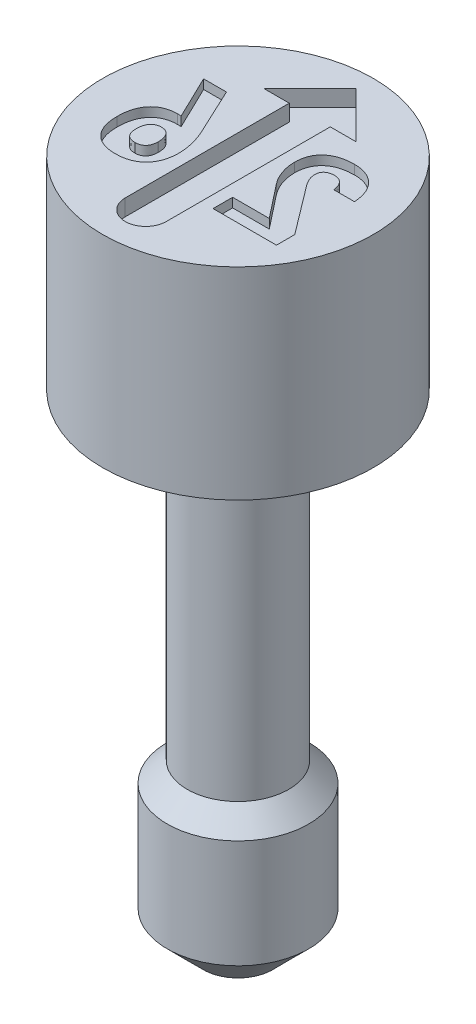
ISO-10303-21;
HEADER;
FILE_DESCRIPTION(('STEP AP214'),'2;1');
FILE_NAME('part.step','',(''),(''),'','','');
FILE_SCHEMA(('AUTOMOTIVE_DESIGN { 1 0 10303 214 1 1 1 1 }'));
ENDSEC;
DATA;
#1=APPLICATION_CONTEXT('core data for automotive mechanical design processes');
#2=APPLICATION_PROTOCOL_DEFINITION('international standard','automotive_design',2000,#1);
#3=PRODUCT_CONTEXT('',#1,'mechanical');
#4=PRODUCT('Part','Part','',(#3));
#5=PRODUCT_RELATED_PRODUCT_CATEGORY('part','',(#4));
#6=PRODUCT_DEFINITION_FORMATION('','',#4);
#7=PRODUCT_DEFINITION_CONTEXT('part definition',#1,'design');
#8=PRODUCT_DEFINITION('design','',#6,#7);
#9=PRODUCT_DEFINITION_SHAPE('','',#8);
#10=(LENGTH_UNIT() NAMED_UNIT(*) SI_UNIT(.MILLI.,.METRE.));
#11=(NAMED_UNIT(*) PLANE_ANGLE_UNIT() SI_UNIT($,.RADIAN.));
#12=(NAMED_UNIT(*) SI_UNIT($,.STERADIAN.) SOLID_ANGLE_UNIT());
#13=UNCERTAINTY_MEASURE_WITH_UNIT(LENGTH_MEASURE(1.E-05),#10,'distance_accuracy_value','');
#14=(GEOMETRIC_REPRESENTATION_CONTEXT(3) GLOBAL_UNCERTAINTY_ASSIGNED_CONTEXT((#13)) GLOBAL_UNIT_ASSIGNED_CONTEXT((#10,
#11,#12)) REPRESENTATION_CONTEXT('',''));
#15=CARTESIAN_POINT('',(0.,0.,0.));
#16=DIRECTION('',(0.,0.,1.));
#17=DIRECTION('',(1.,0.,0.));
#18=AXIS2_PLACEMENT_3D('',#15,#16,#17);
#19=CARTESIAN_POINT('',(0.,17.018,0.));
#20=DIRECTION('',(0.,1.,0.));
#21=DIRECTION('',(0.,0.,1.));
#22=AXIS2_PLACEMENT_3D('',#19,#20,#21);
#23=PLANE('',#22);
#24=DIRECTION('',(1.,0.,0.));
#25=VECTOR('',#24,1.);
#26=CARTESIAN_POINT('',(0.80921684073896,17.018,1.42718515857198));
#27=LINE('',#26,#25);
#28=CARTESIAN_POINT('',(0.80921684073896,17.018,1.42718515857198));
#29=VERTEX_POINT('',#28);
#30=CARTESIAN_POINT('',(2.37975945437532,17.018,1.42718515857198));
#31=VERTEX_POINT('',#30);
#32=EDGE_CURVE('E52',#29,#31,#27,.T.);
#33=ORIENTED_EDGE('',*,*,#32,.F.);
#34=DIRECTION('',(0.,0.,1.));
#35=VECTOR('',#34,1.);
#36=CARTESIAN_POINT('',(0.80921684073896,17.018,0.942276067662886));
#37=LINE('',#36,#35);
#38=CARTESIAN_POINT('',(0.80921684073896,17.018,0.942276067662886));
#39=VERTEX_POINT('',#38);
#40=EDGE_CURVE('E315',#39,#29,#37,.T.);
#41=ORIENTED_EDGE('',*,*,#40,.F.);
#42=DIRECTION('',(-1.,0.,0.));
#43=VECTOR('',#42,1.);
#44=CARTESIAN_POINT('',(1.71679780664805,17.018,0.942276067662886));
#45=LINE('',#44,#43);
#46=CARTESIAN_POINT('',(1.71679780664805,17.018,0.942276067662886));
#47=VERTEX_POINT('',#46);
#48=EDGE_CURVE('E318',#47,#39,#45,.T.);
#49=ORIENTED_EDGE('',*,*,#48,.F.);
#50=DIRECTION('',(0.618183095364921,0.,0.786034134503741));
#51=VECTOR('',#50,1.);
#52=CARTESIAN_POINT('',(1.06303644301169,17.018,0.111003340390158));
#53=LINE('',#52,#51);
#54=CARTESIAN_POINT('',(1.06303644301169,17.018,0.111003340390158));
#55=VERTEX_POINT('',#54);
#56=EDGE_CURVE('E1387',#55,#47,#53,.T.);
#57=ORIENTED_EDGE('',*,*,#56,.F.);
#58=CARTESIAN_POINT('',(0.823829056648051,17.018,-0.575229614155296));
#59=CARTESIAN_POINT('',(0.824519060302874,17.018,-0.544884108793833));
#60=CARTESIAN_POINT('',(0.82590028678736,17.018,-0.484139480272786));
#61=CARTESIAN_POINT('',(0.838368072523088,17.018,-0.393226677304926));
#62=CARTESIAN_POINT('',(0.85845966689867,17.018,-0.302778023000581));
#63=CARTESIAN_POINT('',(0.886052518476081,17.018,-0.213230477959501));
#64=CARTESIAN_POINT('',(0.920329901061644,17.018,-0.126135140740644));
#65=CARTESIAN_POINT('',(0.961469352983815,17.018,-0.0426847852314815));
#66=CARTESIAN_POINT('',(1.00790050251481,17.018,0.0371575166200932));
#67=CARTESIAN_POINT('',(1.04469298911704,17.018,0.0864352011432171));
#68=CARTESIAN_POINT('',(1.06303644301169,17.018,0.111003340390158));
#69=B_SPLINE_CURVE_WITH_KNOTS('',3,(#58,#59,#60,#61,#62,#63,#64,#65,#66,#67,#68),.UNSPECIFIED.,
.F.,.F.,(4,1,1,1,1,1,1,1,4),(0.,0.123046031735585,0.246309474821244,0.371480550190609,
0.498560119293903,0.626024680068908,0.750715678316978,0.875715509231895,1.),.UNSPECIFIED.);
#70=CARTESIAN_POINT('',(0.823829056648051,17.018,-0.575229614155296));
#71=VERTEX_POINT('',#70);
#72=EDGE_CURVE('E1382',#71,#55,#69,.T.);
#73=ORIENTED_EDGE('',*,*,#72,.F.);
#74=DIRECTION('',(0.,0.,1.));
#75=VECTOR('',#74,1.);
#76=CARTESIAN_POINT('',(0.823829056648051,17.018,-0.577394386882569));
#77=LINE('',#76,#75);
#78=CARTESIAN_POINT('',(0.823829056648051,17.018,-0.577394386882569));
#79=VERTEX_POINT('',#78);
#80=EDGE_CURVE('E1376',#79,#71,#77,.T.);
#81=ORIENTED_EDGE('',*,*,#80,.F.);
#82=CARTESIAN_POINT('',(1.60910036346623,17.018,-1.27445120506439));
#83=CARTESIAN_POINT('',(1.5787690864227,17.018,-1.27402034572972));
#84=CARTESIAN_POINT('',(1.51977876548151,17.018,-1.27318238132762));
#85=CARTESIAN_POINT('',(1.43389906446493,17.018,-1.26413681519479));
#86=CARTESIAN_POINT('',(1.3530953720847,17.018,-1.25048441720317));
#87=CARTESIAN_POINT('',(1.27749771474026,17.018,-1.23051161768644));
#88=CARTESIAN_POINT('',(1.2074095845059,17.018,-1.2044588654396));
#89=CARTESIAN_POINT('',(1.14262102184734,17.018,-1.17304566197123));
#90=CARTESIAN_POINT('',(1.08299659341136,17.018,-1.13600431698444));
#91=CARTESIAN_POINT('',(1.02899292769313,17.018,-1.09325565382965));
#92=CARTESIAN_POINT('',(0.980402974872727,17.018,-1.04557633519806));
#93=CARTESIAN_POINT('',(0.938580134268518,17.018,-0.992482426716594));
#94=CARTESIAN_POINT('',(0.902375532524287,17.018,-0.935047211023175));
#95=CARTESIAN_POINT('',(0.874074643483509,17.018,-0.872156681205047));
#96=CARTESIAN_POINT('',(0.850775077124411,17.018,-0.805289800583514));
#97=CARTESIAN_POINT('',(0.835688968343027,17.018,-0.733247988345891));
#98=CARTESIAN_POINT('',(0.825522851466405,17.018,-0.6568794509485));
#99=CARTESIAN_POINT('',(0.824402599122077,17.018,-0.604309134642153));
#100=CARTESIAN_POINT('',(0.823829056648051,17.018,-0.577394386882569));
#101=B_SPLINE_CURVE_WITH_KNOTS('',3,(#82,#83,#84,#85,#86,#87,#88,#89,#90,#91,#92,#93,#94,#95,
#96,#97,#98,#99,#100),.UNSPECIFIED.,.F.,.F.,(4,1,1,1,1,1,1,1,1,1,1,1,1,1,1,1,4),(0.,
0.0762312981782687,0.148259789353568,0.216860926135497,0.28210063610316,0.344528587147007,
0.404571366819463,0.462840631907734,0.520642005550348,0.577409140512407,0.633580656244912,
0.690215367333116,0.747647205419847,0.806597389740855,0.867894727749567,0.932365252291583,1.),.UNSPECIFIED.);
#102=CARTESIAN_POINT('',(1.60910036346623,17.018,-1.27445120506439));
#103=VERTEX_POINT('',#102);
#104=EDGE_CURVE('E1368',#103,#79,#101,.T.);
#105=ORIENTED_EDGE('',*,*,#104,.F.);
#106=CARTESIAN_POINT('',(2.41277223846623,17.018,-0.474026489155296));
#107=CARTESIAN_POINT('',(2.41024065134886,17.018,-0.504940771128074));
#108=CARTESIAN_POINT('',(2.40529904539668,17.018,-0.565284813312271));
#109=CARTESIAN_POINT('',(2.38909831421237,17.018,-0.652575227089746));
#110=CARTESIAN_POINT('',(2.36815950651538,17.018,-0.734796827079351));
#111=CARTESIAN_POINT('',(2.3415225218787,17.018,-0.811933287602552));
#112=CARTESIAN_POINT('',(2.30729390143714,17.018,-0.883091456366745));
#113=CARTESIAN_POINT('',(2.26883700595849,17.018,-0.949758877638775));
#114=CARTESIAN_POINT('',(2.22258299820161,17.018,-1.00987355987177));
#115=CARTESIAN_POINT('',(2.1719515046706,17.018,-1.06544705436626));
#116=CARTESIAN_POINT('',(2.11555707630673,17.018,-1.11439538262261));
#117=CARTESIAN_POINT('',(2.0554251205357,17.018,-1.15757437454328));
#118=CARTESIAN_POINT('',(1.99064634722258,17.018,-1.19350629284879));
#119=CARTESIAN_POINT('',(1.92220556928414,17.018,-1.22331394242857));
#120=CARTESIAN_POINT('',(1.84934397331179,17.018,-1.24593710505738));
#121=CARTESIAN_POINT('',(1.77301330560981,17.018,-1.26288357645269));
#122=CARTESIAN_POINT('',(1.69233743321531,17.018,-1.27265665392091));
#123=CARTESIAN_POINT('',(1.63726855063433,17.018,-1.27384391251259));
#124=CARTESIAN_POINT('',(1.60910036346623,17.018,-1.27445120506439));
#125=B_SPLINE_CURVE_WITH_KNOTS('',3,(#106,#107,#108,#109,#110,#111,#112,#113,#114,#115,#116,
#117,#118,#119,#120,#121,#122,#123,#124),.UNSPECIFIED.,.F.,.F.,(4,1,1,1,1,1,1,1,1,1,1,1,1,1,1,1,
4),(0.,0.073326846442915,0.14313249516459,0.209679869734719,0.273918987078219,0.335762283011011,
0.396210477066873,0.45560885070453,0.514796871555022,0.573764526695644,0.631900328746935,
0.689592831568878,0.748648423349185,0.808163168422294,0.86976604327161,0.933384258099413,1.),.UNSPECIFIED.);
#126=CARTESIAN_POINT('',(2.41277223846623,17.018,-0.474026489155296));
#127=VERTEX_POINT('',#126);
#128=EDGE_CURVE('E1363',#127,#103,#125,.T.);
#129=ORIENTED_EDGE('',*,*,#128,.F.);
#130=DIRECTION('',(0.,0.,-1.));
#131=VECTOR('',#130,1.);
#132=CARTESIAN_POINT('',(2.41277223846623,17.018,-0.472402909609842));
#133=LINE('',#132,#131);
#134=CARTESIAN_POINT('',(2.41277223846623,17.018,-0.472402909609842));
#135=VERTEX_POINT('',#134);
#136=EDGE_CURVE('E1360',#135,#127,#133,.T.);
#137=ORIENTED_EDGE('',*,*,#136,.F.);
#138=DIRECTION('',(1.,0.,0.));
#139=VECTOR('',#138,1.);
#140=CARTESIAN_POINT('',(1.8997211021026,17.018,-0.472402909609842));
#141=LINE('',#140,#139);
#142=CARTESIAN_POINT('',(1.8997211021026,17.018,-0.472402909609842));
#143=VERTEX_POINT('',#142);
#144=EDGE_CURVE('E1357',#143,#135,#141,.T.);
#145=ORIENTED_EDGE('',*,*,#144,.F.);
#146=DIRECTION('',(0.,0.,1.));
#147=VECTOR('',#146,1.);
#148=CARTESIAN_POINT('',(1.8997211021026,17.018,-0.474026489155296));
#149=LINE('',#148,#147);
#150=CARTESIAN_POINT('',(1.8997211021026,17.018,-0.474026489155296));
#151=VERTEX_POINT('',#150);
#152=EDGE_CURVE('E1351',#151,#143,#149,.T.);
#153=ORIENTED_EDGE('',*,*,#152,.F.);
#154=CARTESIAN_POINT('',(1.60531201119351,17.018,-0.789542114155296));
#155=CARTESIAN_POINT('',(1.62491837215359,17.018,-0.788777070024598));
#156=CARTESIAN_POINT('',(1.66301421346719,17.018,-0.787290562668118));
#157=CARTESIAN_POINT('',(1.71694536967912,17.018,-0.770815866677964));
#158=CARTESIAN_POINT('',(1.76554260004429,17.018,-0.74497410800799));
#159=CARTESIAN_POINT('',(1.80743727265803,17.018,-0.708101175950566));
#160=CARTESIAN_POINT('',(1.84212923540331,17.018,-0.661805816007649));
#161=CARTESIAN_POINT('',(1.87028512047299,17.018,-0.607289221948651));
#162=CARTESIAN_POINT('',(1.88940838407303,17.018,-0.543567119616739));
#163=CARTESIAN_POINT('',(1.89617291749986,17.018,-0.497952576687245));
#164=CARTESIAN_POINT('',(1.8997211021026,17.018,-0.474026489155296));
#165=B_SPLINE_CURVE_WITH_KNOTS('',3,(#154,#155,#156,#157,#158,#159,#160,#161,#162,#163,#164),
.UNSPECIFIED.,.F.,.F.,(4,1,1,1,1,1,1,1,4),(0.,0.122603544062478,0.238222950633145,
0.350089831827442,0.465559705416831,0.58502806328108,0.711014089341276,0.848418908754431,1.),.UNSPECIFIED.);
#166=CARTESIAN_POINT('',(1.60531201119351,17.018,-0.789542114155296));
#167=VERTEX_POINT('',#166);
#168=EDGE_CURVE('E1343',#167,#151,#165,.T.);
#169=ORIENTED_EDGE('',*,*,#168,.F.);
#170=CARTESIAN_POINT('',(1.33904496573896,17.018,-0.563323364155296));
#171=CARTESIAN_POINT('',(1.33978426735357,17.018,-0.580375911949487));
#172=CARTESIAN_POINT('',(1.34120065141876,17.018,-0.613045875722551));
#173=CARTESIAN_POINT('',(1.35454521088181,17.018,-0.65907849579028));
#174=CARTESIAN_POINT('',(1.3764162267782,17.018,-0.699165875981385));
#175=CARTESIAN_POINT('',(1.40774080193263,17.018,-0.732277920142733));
#176=CARTESIAN_POINT('',(1.44673750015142,17.018,-0.758467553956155));
#177=CARTESIAN_POINT('',(1.49339813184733,17.018,-0.77692441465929));
#178=CARTESIAN_POINT('',(1.54711218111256,17.018,-0.78750824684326));
#179=CARTESIAN_POINT('',(1.58523822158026,17.018,-0.788840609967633));
#180=CARTESIAN_POINT('',(1.60531201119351,17.018,-0.789542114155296));
#181=B_SPLINE_CURVE_WITH_KNOTS('',3,(#170,#171,#172,#173,#174,#175,#176,#177,#178,#179,#180),
.UNSPECIFIED.,.F.,.F.,(4,1,1,1,1,1,1,1,4),(0.,0.128749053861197,0.246662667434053,
0.359069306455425,0.47107757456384,0.588039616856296,0.711712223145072,0.848213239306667,1.),.UNSPECIFIED.);
#182=CARTESIAN_POINT('',(1.33904496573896,17.018,-0.563323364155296));
#183=VERTEX_POINT('',#182);
#184=EDGE_CURVE('E1338',#183,#167,#181,.T.);
#185=ORIENTED_EDGE('',*,*,#184,.F.);
#186=DIRECTION('',(0.,0.,-1.));
#187=VECTOR('',#186,1.);
#188=CARTESIAN_POINT('',(1.33904496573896,17.018,-0.559535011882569));
#189=LINE('',#188,#187);
#190=CARTESIAN_POINT('',(1.33904496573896,17.018,-0.559535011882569));
#191=VERTEX_POINT('',#190);
#192=EDGE_CURVE('E1332',#191,#183,#189,.T.);
#193=ORIENTED_EDGE('',*,*,#192,.F.);
#194=CARTESIAN_POINT('',(1.46839013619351,17.018,-0.233736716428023));
#195=CARTESIAN_POINT('',(1.44930134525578,17.018,-0.26063384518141));
#196=CARTESIAN_POINT('',(1.41210741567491,17.018,-0.313042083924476));
#197=CARTESIAN_POINT('',(1.37844404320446,17.018,-0.385014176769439));
#198=CARTESIAN_POINT('',(1.3574731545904,17.018,-0.44144119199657));
#199=CARTESIAN_POINT('',(1.34747889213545,17.018,-0.482361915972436));
#200=CARTESIAN_POINT('',(1.34034929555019,17.018,-0.521404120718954));
#201=CARTESIAN_POINT('',(1.33947176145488,17.018,-0.547058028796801));
#202=CARTESIAN_POINT('',(1.33904496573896,17.018,-0.559535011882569));
#203=B_SPLINE_CURVE_WITH_KNOTS('',3,(#194,#195,#196,#197,#198,#199,#200,#201,#202),
.UNSPECIFIED.,.F.,.F.,(4,1,1,1,1,1,4),(0.,0.277375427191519,0.540457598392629,0.666416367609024,
0.784009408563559,0.894951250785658,1.),.UNSPECIFIED.);
#204=CARTESIAN_POINT('',(1.46839013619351,17.018,-0.233736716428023));
#205=VERTEX_POINT('',#204);
#206=EDGE_CURVE('E1327',#205,#191,#203,.T.);
#207=ORIENTED_EDGE('',*,*,#206,.F.);
#208=DIRECTION('',(-0.602458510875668,0.,-0.798150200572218));
#209=VECTOR('',#208,1.);
#210=CARTESIAN_POINT('',(2.37975945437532,17.018,0.97366527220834));
#211=LINE('',#210,#209);
#212=CARTESIAN_POINT('',(2.37975945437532,17.018,0.97366527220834));
#213=VERTEX_POINT('',#212);
#214=EDGE_CURVE('E1324',#213,#205,#211,.T.);
#215=ORIENTED_EDGE('',*,*,#214,.F.);
#216=DIRECTION('',(0.,0.,-1.));
#217=VECTOR('',#216,1.);
#218=CARTESIAN_POINT('',(2.37975945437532,17.018,1.42718515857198));
#219=LINE('',#218,#217);
#220=EDGE_CURVE('E1322',#31,#213,#219,.T.);
#221=ORIENTED_EDGE('',*,*,#220,.F.);
#222=EDGE_LOOP('',(#33,#41,#49,#57,#73,#81,#105,#129,#137,#145,#153,#169,#185,#193,#207,#215,#221));
#223=FACE_BOUND('',#222,.T.);
#224=CARTESIAN_POINT('',(-2.35756423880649,17.018,0.639749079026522));
#225=CARTESIAN_POINT('',(-2.35698217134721,17.018,0.67134674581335));
#226=CARTESIAN_POINT('',(-2.35584506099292,17.018,0.733075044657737));
#227=CARTESIAN_POINT('',(-2.34581482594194,17.018,0.822789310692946));
#228=CARTESIAN_POINT('',(-2.33044637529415,17.018,0.907235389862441));
#229=CARTESIAN_POINT('',(-2.30825876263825,17.018,0.9861030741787));
#230=CARTESIAN_POINT('',(-2.27955801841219,17.018,1.05958833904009));
#231=CARTESIAN_POINT('',(-2.24429959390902,17.018,1.12771599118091));
#232=CARTESIAN_POINT('',(-2.20232127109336,17.018,1.19014978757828));
#233=CARTESIAN_POINT('',(-2.15481691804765,17.018,1.247342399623));
#234=CARTESIAN_POINT('',(-2.10090267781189,17.018,1.29766946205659));
#235=CARTESIAN_POINT('',(-2.04202457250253,17.018,1.34189051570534));
#236=CARTESIAN_POINT('',(-1.97797540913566,17.018,1.37967297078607));
#237=CARTESIAN_POINT('',(-1.90780694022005,17.018,1.40906478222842));
#238=CARTESIAN_POINT('',(-1.83312441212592,17.018,1.43319202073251));
#239=CARTESIAN_POINT('',(-1.7528998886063,17.018,1.44958086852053));
#240=CARTESIAN_POINT('',(-1.66783142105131,17.018,1.46023576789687));
#241=CARTESIAN_POINT('',(-1.60930849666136,17.018,1.46128435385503));
#242=CARTESIAN_POINT('',(-1.57932844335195,17.018,1.46182152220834));
#243=B_SPLINE_CURVE_WITH_KNOTS('',3,(#224,#225,#226,#227,#228,#229,#230,#231,#232,#233,#234,
#235,#236,#237,#238,#239,#240,#241,#242),.UNSPECIFIED.,.F.,.F.,(4,1,1,1,1,1,1,1,1,1,1,1,1,1,1,1,
4),(0.,0.0736363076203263,0.143853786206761,0.210167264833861,0.273535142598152,
0.334525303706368,0.393774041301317,0.451974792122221,0.509587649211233,0.566708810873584,
0.623480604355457,0.680964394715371,0.739551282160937,0.800463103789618,0.863640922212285,
0.930146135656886,1.),.UNSPECIFIED.);
#244=CARTESIAN_POINT('',(-2.35756423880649,17.018,0.639749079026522));
#245=VERTEX_POINT('',#244);
#246=CARTESIAN_POINT('',(-1.57932844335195,17.018,1.46182152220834));
#247=VERTEX_POINT('',#246);
#248=EDGE_CURVE('E60',#245,#247,#243,.T.);
#249=ORIENTED_EDGE('',*,*,#248,.F.);
#250=DIRECTION('',(0.,0.,1.));
#251=VECTOR('',#250,1.);
#252=CARTESIAN_POINT('',(-2.35756423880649,17.018,0.637584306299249));
#253=LINE('',#252,#251);
#254=CARTESIAN_POINT('',(-2.35756423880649,17.018,0.637584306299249));
#255=VERTEX_POINT('',#254);
#256=EDGE_CURVE('E436',#255,#245,#253,.T.);
#257=ORIENTED_EDGE('',*,*,#256,.F.);
#258=CARTESIAN_POINT('',(-1.66537815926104,17.018,-0.166087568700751));
#259=CARTESIAN_POINT('',(-1.69210362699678,17.018,-0.165481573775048));
#260=CARTESIAN_POINT('',(-1.74411817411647,17.018,-0.164302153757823));
#261=CARTESIAN_POINT('',(-1.8198037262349,17.018,-0.154652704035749));
#262=CARTESIAN_POINT('',(-1.89053756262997,17.018,-0.137552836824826));
#263=CARTESIAN_POINT('',(-1.95721011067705,17.018,-0.115105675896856));
#264=CARTESIAN_POINT('',(-2.0191213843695,17.018,-0.0851725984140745));
#265=CARTESIAN_POINT('',(-2.07642492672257,17.018,-0.0485460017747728));
#266=CARTESIAN_POINT('',(-2.12925429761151,17.018,-0.00566481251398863));
#267=CARTESIAN_POINT('',(-2.1769132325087,17.018,0.0439858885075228));
#268=CARTESIAN_POINT('',(-2.21984865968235,17.018,0.0991397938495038));
#269=CARTESIAN_POINT('',(-2.25664257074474,17.018,0.160353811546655));
#270=CARTESIAN_POINT('',(-2.28826220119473,17.018,0.226605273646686));
#271=CARTESIAN_POINT('',(-2.31345267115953,17.018,0.298556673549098));
#272=CARTESIAN_POINT('',(-2.33364170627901,17.018,0.375623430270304));
#273=CARTESIAN_POINT('',(-2.34727377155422,17.018,0.458242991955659));
#274=CARTESIAN_POINT('',(-2.35628917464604,17.018,0.54610256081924));
#275=CARTESIAN_POINT('',(-2.3571314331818,17.018,0.606531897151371));
#276=CARTESIAN_POINT('',(-2.35756423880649,17.018,0.637584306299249));
#277=B_SPLINE_CURVE_WITH_KNOTS('',3,(#258,#259,#260,#261,#262,#263,#264,#265,#266,#267,#268,
#269,#270,#271,#272,#273,#274,#275,#276),.UNSPECIFIED.,.F.,.F.,(4,1,1,1,1,1,1,1,1,1,1,1,1,1,1,1,
4),(0.,0.0665766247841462,0.129575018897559,0.189644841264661,0.24763903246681,0.30453064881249,
0.36051483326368,0.416743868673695,0.473642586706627,0.531631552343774,0.590524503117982,
0.65124161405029,0.714220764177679,0.780176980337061,0.849489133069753,0.922658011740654,1.),.UNSPECIFIED.);
#278=CARTESIAN_POINT('',(-1.66537815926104,17.018,-0.166087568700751));
#279=VERTEX_POINT('',#278);
#280=EDGE_CURVE('E615',#279,#255,#277,.T.);
#281=ORIENTED_EDGE('',*,*,#280,.F.);
#282=CARTESIAN_POINT('',(-1.32713242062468,17.018,0.0157533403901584));
#283=CARTESIAN_POINT('',(-1.33533105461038,17.018,0.00118977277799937));
#284=CARTESIAN_POINT('',(-1.35139934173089,17.018,-0.0273529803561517));
#285=CARTESIAN_POINT('',(-1.38305140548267,17.018,-0.0642939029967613));
#286=CARTESIAN_POINT('',(-1.41835269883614,17.018,-0.096373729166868));
#287=CARTESIAN_POINT('',(-1.45917917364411,17.018,-0.121889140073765));
#288=CARTESIAN_POINT('',(-1.50432047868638,17.018,-0.142075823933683));
#289=CARTESIAN_POINT('',(-1.55414582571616,17.018,-0.155837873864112));
#290=CARTESIAN_POINT('',(-1.60822457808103,17.018,-0.164866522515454));
#291=CARTESIAN_POINT('',(-1.64585561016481,17.018,-0.1656704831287));
#292=CARTESIAN_POINT('',(-1.66537815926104,17.018,-0.166087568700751));
#293=B_SPLINE_CURVE_WITH_KNOTS('',3,(#282,#283,#284,#285,#286,#287,#288,#289,#290,#291,#292),
.UNSPECIFIED.,.F.,.F.,(4,1,1,1,1,1,1,1,4),(0.,0.123274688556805,0.241602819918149,
0.357777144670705,0.474683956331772,0.595870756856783,0.722082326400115,0.85581948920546,1.),.UNSPECIFIED.);
#294=CARTESIAN_POINT('',(-1.56917951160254,17.018,-0.157973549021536));
#295=VERTEX_POINT('',#294);
#296=EDGE_CURVE('E620',#295,#279,#293,.T.);
#297=ORIENTED_EDGE('',*,*,#296,.F.);
#298=DIRECTION('',(0.435377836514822,0.,0.900247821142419));
#299=VECTOR('',#298,1.);
#300=CARTESIAN_POINT('',(-2.09237957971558,17.018,-1.23981484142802));
#301=LINE('',#300,#299);
#302=CARTESIAN_POINT('',(-2.09237957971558,17.018,-1.23981484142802));
#303=VERTEX_POINT('',#302);
#304=EDGE_CURVE('E628',#303,#295,#301,.T.);
#305=ORIENTED_EDGE('',*,*,#304,.F.);
#306=DIRECTION('',(-1.,0.,0.));
#307=VECTOR('',#306,1.);
#308=CARTESIAN_POINT('',(-1.52629151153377,17.018,-1.23981484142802));
#309=LINE('',#308,#307);
#310=CARTESIAN_POINT('',(-1.52629151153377,17.018,-1.23981484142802));
#311=VERTEX_POINT('',#310);
#312=EDGE_CURVE('E634',#311,#303,#309,.T.);
#313=ORIENTED_EDGE('',*,*,#312,.F.);
#314=DIRECTION('',(-0.424073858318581,0.,-0.905627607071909));
#315=VECTOR('',#314,1.);
#316=CARTESIAN_POINT('',(-0.987263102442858,17.018,-0.0886969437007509));
#317=LINE('',#316,#315);
#318=CARTESIAN_POINT('',(-0.987263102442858,17.018,-0.0886969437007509));
#319=VERTEX_POINT('',#318);
#320=EDGE_CURVE('E637',#319,#311,#317,.T.);
#321=ORIENTED_EDGE('',*,*,#320,.F.);
#322=CARTESIAN_POINT('',(-0.803257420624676,17.018,0.652737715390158));
#323=CARTESIAN_POINT('',(-0.803940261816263,17.018,0.623490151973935));
#324=CARTESIAN_POINT('',(-0.805330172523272,17.018,0.563957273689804));
#325=CARTESIAN_POINT('',(-0.815023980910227,17.018,0.47360076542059));
#326=CARTESIAN_POINT('',(-0.830002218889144,17.018,0.380827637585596));
#327=CARTESIAN_POINT('',(-0.851972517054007,17.018,0.286468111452));
#328=CARTESIAN_POINT('',(-0.87876216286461,17.018,0.191488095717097));
#329=CARTESIAN_POINT('',(-0.910497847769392,17.018,0.0969811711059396));
#330=CARTESIAN_POINT('',(-0.945786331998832,17.018,0.00316990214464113));
#331=CARTESIAN_POINT('',(-0.973398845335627,17.018,-0.057989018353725));
#332=CARTESIAN_POINT('',(-0.987263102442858,17.018,-0.0886969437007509));
#333=B_SPLINE_CURVE_WITH_KNOTS('',3,(#322,#323,#324,#325,#326,#327,#328,#329,#330,#331,#332),
.UNSPECIFIED.,.F.,.F.,(4,1,1,1,1,1,1,1,4),(0.,0.114002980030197,0.232050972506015,
0.353906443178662,0.480147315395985,0.609491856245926,0.73847457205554,0.868687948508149,1.),.UNSPECIFIED.);
#334=CARTESIAN_POINT('',(-0.803257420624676,17.018,0.652737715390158));
#335=VERTEX_POINT('',#334);
#336=EDGE_CURVE('E640',#335,#319,#333,.T.);
#337=ORIENTED_EDGE('',*,*,#336,.F.);
#338=DIRECTION('',(0.,0.,-1.));
#339=VECTOR('',#338,1.);
#340=CARTESIAN_POINT('',(-0.803257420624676,17.018,0.654361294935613));
#341=LINE('',#340,#339);
#342=CARTESIAN_POINT('',(-0.803257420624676,17.018,0.654361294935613));
#343=VERTEX_POINT('',#342);
#344=EDGE_CURVE('E645',#343,#335,#341,.T.);
#345=ORIENTED_EDGE('',*,*,#344,.F.);
#346=CARTESIAN_POINT('',(-1.57932844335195,17.018,1.46182152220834));
#347=CARTESIAN_POINT('',(-1.54935727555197,17.018,1.46122035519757));
#348=CARTESIAN_POINT('',(-1.49105206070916,17.018,1.46005085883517));
#349=CARTESIAN_POINT('',(-1.40623393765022,17.018,1.4503541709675));
#350=CARTESIAN_POINT('',(-1.32672865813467,17.018,1.43351154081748));
#351=CARTESIAN_POINT('',(-1.2521871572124,17.018,1.41026763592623));
#352=CARTESIAN_POINT('',(-1.18260680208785,17.018,1.38055505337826));
#353=CARTESIAN_POINT('',(-1.11829593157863,17.018,1.3441277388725));
#354=CARTESIAN_POINT('',(-1.05922275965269,17.018,1.30096002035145));
#355=CARTESIAN_POINT('',(-1.00568606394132,17.018,1.25114514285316));
#356=CARTESIAN_POINT('',(-0.958062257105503,17.018,1.19530450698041));
#357=CARTESIAN_POINT('',(-0.916464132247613,17.018,1.13398357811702));
#358=CARTESIAN_POINT('',(-0.881242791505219,17.018,1.0672022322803));
#359=CARTESIAN_POINT('',(-0.852676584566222,17.018,0.994926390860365));
#360=CARTESIAN_POINT('',(-0.830271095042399,17.018,0.917378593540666));
#361=CARTESIAN_POINT('',(-0.815117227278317,17.018,0.834505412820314));
#362=CARTESIAN_POINT('',(-0.804911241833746,17.018,0.746255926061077));
#363=CARTESIAN_POINT('',(-0.803819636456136,17.018,0.685600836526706));
#364=CARTESIAN_POINT('',(-0.803257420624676,17.018,0.654361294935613));
#365=B_SPLINE_CURVE_WITH_KNOTS('',3,(#346,#347,#348,#349,#350,#351,#352,#353,#354,#355,#356,
#357,#358,#359,#360,#361,#362,#363,#364),.UNSPECIFIED.,.F.,.F.,(4,1,1,1,1,1,1,1,1,1,1,1,1,1,1,1,
4),(0.,0.0706034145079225,0.137350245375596,0.20079014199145,0.261822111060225,
0.321037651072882,0.37871381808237,0.435588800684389,0.493032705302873,0.550614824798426,
0.60814515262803,0.667276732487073,0.728130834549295,0.790952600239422,0.85714223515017,
0.926423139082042,1.),.UNSPECIFIED.);
#366=EDGE_CURVE('E651',#247,#343,#365,.T.);
#367=ORIENTED_EDGE('',*,*,#366,.F.);
#368=EDGE_LOOP('',(#249,#257,#281,#297,#305,#313,#321,#337,#345,#367));
#369=FACE_BOUND('',#368,.T.);
#370=CARTESIAN_POINT('',(0.,17.018,2.286));
#371=DIRECTION('',(0.,1.,0.));
#372=DIRECTION('',(0.,0.,1.));
#373=AXIS2_PLACEMENT_3D('',#370,#371,#372);
#374=CIRCLE('',#373,0.508);
#375=CARTESIAN_POINT('',(-0.508,17.018,2.286));
#376=VERTEX_POINT('',#375);
#377=CARTESIAN_POINT('',(0.508,17.018,2.286));
#378=VERTEX_POINT('',#377);
#379=EDGE_CURVE('E570',#376,#378,#374,.T.);
#380=ORIENTED_EDGE('',*,*,#379,.F.);
#381=DIRECTION('',(0.,0.,1.));
#382=VECTOR('',#381,1.);
#383=CARTESIAN_POINT('',(-0.508,17.018,2.286));
#384=LINE('',#383,#382);
#385=CARTESIAN_POINT('',(-0.508,17.018,-1.778));
#386=VERTEX_POINT('',#385);
#387=EDGE_CURVE('E551',#386,#376,#384,.T.);
#388=ORIENTED_EDGE('',*,*,#387,.F.);
#389=DIRECTION('',(1.,0.,0.));
#390=VECTOR('',#389,1.);
#391=CARTESIAN_POINT('',(-0.508,17.018,-1.778));
#392=LINE('',#391,#390);
#393=CARTESIAN_POINT('',(-1.143,17.018,-1.778));
#394=VERTEX_POINT('',#393);
#395=EDGE_CURVE('E555',#394,#386,#392,.T.);
#396=ORIENTED_EDGE('',*,*,#395,.F.);
#397=DIRECTION('',(-0.707106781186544,0.,0.707106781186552));
#398=VECTOR('',#397,1.);
#399=CARTESIAN_POINT('',(0.,17.018,-2.92100000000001));
#400=LINE('',#399,#398);
#401=CARTESIAN_POINT('',(0.,17.018,-2.92100000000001));
#402=VERTEX_POINT('',#401);
#403=EDGE_CURVE('E558',#402,#394,#400,.T.);
#404=ORIENTED_EDGE('',*,*,#403,.F.);
#405=DIRECTION('',(-0.707106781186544,0.,-0.707106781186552));
#406=VECTOR('',#405,1.);
#407=CARTESIAN_POINT('',(1.143,17.018,-1.778));
#408=LINE('',#407,#406);
#409=CARTESIAN_POINT('',(1.143,17.018,-1.778));
#410=VERTEX_POINT('',#409);
#411=EDGE_CURVE('E561',#410,#402,#408,.T.);
#412=ORIENTED_EDGE('',*,*,#411,.F.);
#413=DIRECTION('',(1.,0.,0.));
#414=VECTOR('',#413,1.);
#415=CARTESIAN_POINT('',(0.508,17.018,-1.778));
#416=LINE('',#415,#414);
#417=CARTESIAN_POINT('',(0.508,17.018,-1.778));
#418=VERTEX_POINT('',#417);
#419=EDGE_CURVE('E564',#418,#410,#416,.T.);
#420=ORIENTED_EDGE('',*,*,#419,.F.);
#421=DIRECTION('',(0.,0.,-1.));
#422=VECTOR('',#421,1.);
#423=CARTESIAN_POINT('',(0.508,17.018,2.286));
#424=LINE('',#423,#422);
#425=EDGE_CURVE('E567',#378,#418,#424,.T.);
#426=ORIENTED_EDGE('',*,*,#425,.F.);
#427=EDGE_LOOP('',(#380,#388,#396,#404,#412,#420,#426));
#428=FACE_BOUND('',#427,.T.);
#429=CARTESIAN_POINT('',(0.,17.018,0.));
#430=DIRECTION('',(0.,-1.,0.));
#431=DIRECTION('',(0.,0.,-1.));
#432=AXIS2_PLACEMENT_3D('',#429,#430,#431);
#433=CIRCLE('',#432,3.3528);
#434=CARTESIAN_POINT('',(0.,17.018,-3.3528));
#435=VERTEX_POINT('',#434);
#436=EDGE_CURVE('E11',#435,#435,#433,.T.);
#437=ORIENTED_EDGE('',*,*,#436,.F.);
#438=EDGE_LOOP('',(#437));
#439=FACE_BOUND('',#438,.T.);
#440=ADVANCED_FACE('F37',(#223,#369,#428,#439),#23,.T.);
#441=CARTESIAN_POINT('',(0.,0.,0.));
#442=DIRECTION('',(0.,-1.,0.));
#443=DIRECTION('',(0.,0.,-1.));
#444=AXIS2_PLACEMENT_3D('',#441,#442,#443);
#445=CYLINDRICAL_SURFACE('',#444,3.3528);
#446=ORIENTED_EDGE('',*,*,#436,.T.);
#447=EDGE_LOOP('',(#446));
#448=FACE_BOUND('',#447,.T.);
#449=CARTESIAN_POINT('',(0.,12.0142,0.));
#450=DIRECTION('',(0.,-1.,0.));
#451=DIRECTION('',(0.,0.,-1.));
#452=AXIS2_PLACEMENT_3D('',#449,#450,#451);
#453=CIRCLE('',#452,3.3528);
#454=CARTESIAN_POINT('',(0.,12.0142,-3.3528));
#455=VERTEX_POINT('',#454);
#456=EDGE_CURVE('E45',#455,#455,#453,.T.);
#457=ORIENTED_EDGE('',*,*,#456,.F.);
#458=EDGE_LOOP('',(#457));
#459=FACE_BOUND('',#458,.T.);
#460=ADVANCED_FACE('F507',(#448,#459),#445,.T.);
#461=CARTESIAN_POINT('',(3.3528,12.0142,0.));
#462=DIRECTION('',(0.,-1.,0.));
#463=DIRECTION('',(0.,0.,-1.));
#464=AXIS2_PLACEMENT_3D('',#461,#462,#463);
#465=PLANE('',#464);
#466=ORIENTED_EDGE('',*,*,#456,.T.);
#467=EDGE_LOOP('',(#466));
#468=FACE_BOUND('',#467,.T.);
#469=CARTESIAN_POINT('',(0.,12.0142,0.));
#470=DIRECTION('',(0.,-1.,0.));
#471=DIRECTION('',(0.,0.,-1.));
#472=AXIS2_PLACEMENT_3D('',#469,#470,#471);
#473=CIRCLE('',#472,1.2573);
#474=CARTESIAN_POINT('',(0.,12.0142,-1.2573));
#475=VERTEX_POINT('',#474);
#476=EDGE_CURVE('E519',#475,#475,#473,.T.);
#477=ORIENTED_EDGE('',*,*,#476,.F.);
#478=EDGE_LOOP('',(#477));
#479=FACE_BOUND('',#478,.T.);
#480=ADVANCED_FACE('F504',(#468,#479),#465,.T.);
#481=CARTESIAN_POINT('',(0.,0.,0.));
#482=DIRECTION('',(0.,-1.,0.));
#483=DIRECTION('',(0.,0.,-1.));
#484=AXIS2_PLACEMENT_3D('',#481,#482,#483);
#485=CYLINDRICAL_SURFACE('',#484,1.2573);
#486=ORIENTED_EDGE('',*,*,#476,.T.);
#487=EDGE_LOOP('',(#486));
#488=FACE_BOUND('',#487,.T.);
#489=CARTESIAN_POINT('',(0.,4.064,0.));
#490=DIRECTION('',(0.,-1.,0.));
#491=DIRECTION('',(0.,0.,-1.));
#492=AXIS2_PLACEMENT_3D('',#489,#490,#491);
#493=CIRCLE('',#492,1.2573);
#494=CARTESIAN_POINT('',(0.,4.064,-1.2573));
#495=VERTEX_POINT('',#494);
#496=EDGE_CURVE('E521',#495,#495,#493,.T.);
#497=ORIENTED_EDGE('',*,*,#496,.F.);
#498=EDGE_LOOP('',(#497));
#499=FACE_BOUND('',#498,.T.);
#500=ADVANCED_FACE('F500',(#488,#499),#485,.T.);
#501=CARTESIAN_POINT('',(0.,3.56870000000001,0.));
#502=DIRECTION('',(0.,-1.,0.));
#503=DIRECTION('',(0.,0.,-1.));
#504=AXIS2_PLACEMENT_3D('',#501,#502,#503);
#505=CONICAL_SURFACE('',#504,1.7526,0.785398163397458);
#506=ORIENTED_EDGE('',*,*,#496,.T.);
#507=EDGE_LOOP('',(#506));
#508=FACE_BOUND('',#507,.T.);
#509=CARTESIAN_POINT('',(0.,3.56870000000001,0.));
#510=DIRECTION('',(0.,-1.,0.));
#511=DIRECTION('',(0.,0.,-1.));
#512=AXIS2_PLACEMENT_3D('',#509,#510,#511);
#513=CIRCLE('',#512,1.7526);
#514=CARTESIAN_POINT('',(0.,3.56870000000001,-1.7526));
#515=VERTEX_POINT('',#514);
#516=EDGE_CURVE('E526',#515,#515,#513,.T.);
#517=ORIENTED_EDGE('',*,*,#516,.F.);
#518=EDGE_LOOP('',(#517));
#519=FACE_BOUND('',#518,.T.);
#520=ADVANCED_FACE('F496',(#508,#519),#505,.T.);
#521=CARTESIAN_POINT('',(0.,0.,0.));
#522=DIRECTION('',(0.,-1.,0.));
#523=DIRECTION('',(0.,0.,-1.));
#524=AXIS2_PLACEMENT_3D('',#521,#522,#523);
#525=CYLINDRICAL_SURFACE('',#524,1.7526);
#526=ORIENTED_EDGE('',*,*,#516,.T.);
#527=EDGE_LOOP('',(#526));
#528=FACE_BOUND('',#527,.T.);
#529=CARTESIAN_POINT('',(0.,0.889,0.));
#530=DIRECTION('',(0.,-1.,0.));
#531=DIRECTION('',(0.,0.,-1.));
#532=AXIS2_PLACEMENT_3D('',#529,#530,#531);
#533=CIRCLE('',#532,1.7526);
#534=CARTESIAN_POINT('',(0.,0.889,-1.7526));
#535=VERTEX_POINT('',#534);
#536=EDGE_CURVE('E529',#535,#535,#533,.T.);
#537=ORIENTED_EDGE('',*,*,#536,.F.);
#538=EDGE_LOOP('',(#537));
#539=FACE_BOUND('',#538,.T.);
#540=ADVANCED_FACE('F492',(#528,#539),#525,.T.);
#541=CARTESIAN_POINT('',(0.,0.,0.));
#542=DIRECTION('',(0.,1.,0.));
#543=DIRECTION('',(0.,0.,1.));
#544=AXIS2_PLACEMENT_3D('',#541,#542,#543);
#545=CONICAL_SURFACE('',#544,0.863600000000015,0.78539816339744);
#546=ORIENTED_EDGE('',*,*,#536,.T.);
#547=EDGE_LOOP('',(#546));
#548=FACE_BOUND('',#547,.T.);
#549=CARTESIAN_POINT('',(0.,0.,0.));
#550=DIRECTION('',(0.,-1.,0.));
#551=DIRECTION('',(0.,0.,-1.));
#552=AXIS2_PLACEMENT_3D('',#549,#550,#551);
#553=CIRCLE('',#552,0.863600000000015);
#554=CARTESIAN_POINT('',(0.,0.,-0.863600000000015));
#555=VERTEX_POINT('',#554);
#556=EDGE_CURVE('E532',#555,#555,#553,.T.);
#557=ORIENTED_EDGE('',*,*,#556,.F.);
#558=EDGE_LOOP('',(#557));
#559=FACE_BOUND('',#558,.T.);
#560=ADVANCED_FACE('F488',(#548,#559),#545,.T.);
#561=CARTESIAN_POINT('',(0.863600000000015,0.,0.));
#562=DIRECTION('',(0.,-1.,0.));
#563=DIRECTION('',(0.,0.,-1.));
#564=AXIS2_PLACEMENT_3D('',#561,#562,#563);
#565=PLANE('',#564);
#566=ORIENTED_EDGE('',*,*,#556,.T.);
#567=EDGE_LOOP('',(#566));
#568=FACE_BOUND('',#567,.T.);
#569=ADVANCED_FACE('F484',(#568),#565,.T.);
#570=CARTESIAN_POINT('',(0.,16.6116,2.286));
#571=DIRECTION('',(0.,1.,0.));
#572=DIRECTION('',(0.,0.,1.));
#573=AXIS2_PLACEMENT_3D('',#570,#571,#572);
#574=CYLINDRICAL_SURFACE('',#573,0.508);
#575=ORIENTED_EDGE('',*,*,#379,.T.);
#576=DIRECTION('',(0.,1.,0.));
#577=VECTOR('',#576,1.);
#578=CARTESIAN_POINT('',(0.508,16.6116,2.286));
#579=LINE('',#578,#577);
#580=CARTESIAN_POINT('',(0.508,16.6116,2.286));
#581=VERTEX_POINT('',#580);
#582=EDGE_CURVE('E536',#581,#378,#579,.T.);
#583=ORIENTED_EDGE('',*,*,#582,.F.);
#584=CARTESIAN_POINT('',(0.,16.6116,2.286));
#585=DIRECTION('',(0.,1.,0.));
#586=DIRECTION('',(0.,0.,1.));
#587=AXIS2_PLACEMENT_3D('',#584,#585,#586);
#588=CIRCLE('',#587,0.508);
#589=CARTESIAN_POINT('',(-0.508,16.6116,2.286));
#590=VERTEX_POINT('',#589);
#591=EDGE_CURVE('E554',#590,#581,#588,.T.);
#592=ORIENTED_EDGE('',*,*,#591,.F.);
#593=DIRECTION('',(0.,1.,0.));
#594=VECTOR('',#593,1.);
#595=CARTESIAN_POINT('',(-0.508,16.6116,2.286));
#596=LINE('',#595,#594);
#597=EDGE_CURVE('E535',#590,#376,#596,.T.);
#598=ORIENTED_EDGE('',*,*,#597,.T.);
#599=EDGE_LOOP('',(#575,#583,#592,#598));
#600=FACE_BOUND('',#599,.T.);
#601=ADVANCED_FACE('F462',(#600),#574,.F.);
#602=CARTESIAN_POINT('',(-0.508,16.6116,2.286));
#603=DIRECTION('',(-1.,0.,0.));
#604=DIRECTION('',(0.,0.,1.));
#605=AXIS2_PLACEMENT_3D('',#602,#603,#604);
#606=PLANE('',#605);
#607=ORIENTED_EDGE('',*,*,#387,.T.);
#608=ORIENTED_EDGE('',*,*,#597,.F.);
#609=DIRECTION('',(0.,0.,1.));
#610=VECTOR('',#609,1.);
#611=CARTESIAN_POINT('',(-0.508,16.6116,2.286));
#612=LINE('',#611,#610);
#613=CARTESIAN_POINT('',(-0.508,16.6116,-1.778));
#614=VERTEX_POINT('',#613);
#615=EDGE_CURVE('E540',#614,#590,#612,.T.);
#616=ORIENTED_EDGE('',*,*,#615,.F.);
#617=DIRECTION('',(0.,1.,0.));
#618=VECTOR('',#617,1.);
#619=CARTESIAN_POINT('',(-0.508,16.6116,-1.778));
#620=LINE('',#619,#618);
#621=EDGE_CURVE('E548',#614,#386,#620,.T.);
#622=ORIENTED_EDGE('',*,*,#621,.T.);
#623=EDGE_LOOP('',(#607,#608,#616,#622));
#624=FACE_BOUND('',#623,.T.);
#625=ADVANCED_FACE('F458',(#624),#606,.F.);
#626=CARTESIAN_POINT('',(-0.508,16.6116,-1.778));
#627=DIRECTION('',(0.,0.,1.));
#628=DIRECTION('',(1.,0.,0.));
#629=AXIS2_PLACEMENT_3D('',#626,#627,#628);
#630=PLANE('',#629);
#631=ORIENTED_EDGE('',*,*,#395,.T.);
#632=ORIENTED_EDGE('',*,*,#621,.F.);
#633=DIRECTION('',(1.,0.,0.));
#634=VECTOR('',#633,1.);
#635=CARTESIAN_POINT('',(-0.508,16.6116,-1.778));
#636=LINE('',#635,#634);
#637=CARTESIAN_POINT('',(-1.143,16.6116,-1.778));
#638=VERTEX_POINT('',#637);
#639=EDGE_CURVE('E575',#638,#614,#636,.T.);
#640=ORIENTED_EDGE('',*,*,#639,.F.);
#641=DIRECTION('',(0.,1.,0.));
#642=VECTOR('',#641,1.);
#643=CARTESIAN_POINT('',(-1.143,16.6116,-1.778));
#644=LINE('',#643,#642);
#645=EDGE_CURVE('E546',#638,#394,#644,.T.);
#646=ORIENTED_EDGE('',*,*,#645,.T.);
#647=EDGE_LOOP('',(#631,#632,#640,#646));
#648=FACE_BOUND('',#647,.T.);
#649=ADVANCED_FACE('F461',(#648),#630,.F.);
#650=CARTESIAN_POINT('',(0.,16.6116,-2.92100000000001));
#651=DIRECTION('',(-0.707106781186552,0.,-0.707106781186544));
#652=DIRECTION('',(-0.707106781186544,0.,0.707106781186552));
#653=AXIS2_PLACEMENT_3D('',#650,#651,#652);
#654=PLANE('',#653);
#655=ORIENTED_EDGE('',*,*,#403,.T.);
#656=ORIENTED_EDGE('',*,*,#645,.F.);
#657=DIRECTION('',(-0.707106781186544,0.,0.707106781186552));
#658=VECTOR('',#657,1.);
#659=CARTESIAN_POINT('',(0.,16.6116,-2.92100000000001));
#660=LINE('',#659,#658);
#661=CARTESIAN_POINT('',(0.,16.6116,-2.92100000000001));
#662=VERTEX_POINT('',#661);
#663=EDGE_CURVE('E578',#662,#638,#660,.T.);
#664=ORIENTED_EDGE('',*,*,#663,.F.);
#665=DIRECTION('',(0.,1.,0.));
#666=VECTOR('',#665,1.);
#667=CARTESIAN_POINT('',(0.,16.6116,-2.92100000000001));
#668=LINE('',#667,#666);
#669=EDGE_CURVE('E544',#662,#402,#668,.T.);
#670=ORIENTED_EDGE('',*,*,#669,.T.);
#671=EDGE_LOOP('',(#655,#656,#664,#670));
#672=FACE_BOUND('',#671,.T.);
#673=ADVANCED_FACE('F466',(#672),#654,.F.);
#674=CARTESIAN_POINT('',(1.143,16.6116,-1.778));
#675=DIRECTION('',(0.707106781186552,0.,-0.707106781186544));
#676=DIRECTION('',(-0.707106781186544,0.,-0.707106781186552));
#677=AXIS2_PLACEMENT_3D('',#674,#675,#676);
#678=PLANE('',#677);
#679=ORIENTED_EDGE('',*,*,#411,.T.);
#680=ORIENTED_EDGE('',*,*,#669,.F.);
#681=DIRECTION('',(-0.707106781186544,0.,-0.707106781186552));
#682=VECTOR('',#681,1.);
#683=CARTESIAN_POINT('',(1.143,16.6116,-1.778));
#684=LINE('',#683,#682);
#685=CARTESIAN_POINT('',(1.143,16.6116,-1.778));
#686=VERTEX_POINT('',#685);
#687=EDGE_CURVE('E581',#686,#662,#684,.T.);
#688=ORIENTED_EDGE('',*,*,#687,.F.);
#689=DIRECTION('',(0.,1.,0.));
#690=VECTOR('',#689,1.);
#691=CARTESIAN_POINT('',(1.143,16.6116,-1.778));
#692=LINE('',#691,#690);
#693=EDGE_CURVE('E542',#686,#410,#692,.T.);
#694=ORIENTED_EDGE('',*,*,#693,.T.);
#695=EDGE_LOOP('',(#679,#680,#688,#694));
#696=FACE_BOUND('',#695,.T.);
#697=ADVANCED_FACE('F470',(#696),#678,.F.);
#698=CARTESIAN_POINT('',(0.508,16.6116,-1.778));
#699=DIRECTION('',(0.,0.,1.));
#700=DIRECTION('',(1.,0.,0.));
#701=AXIS2_PLACEMENT_3D('',#698,#699,#700);
#702=PLANE('',#701);
#703=ORIENTED_EDGE('',*,*,#419,.T.);
#704=ORIENTED_EDGE('',*,*,#693,.F.);
#705=DIRECTION('',(1.,0.,0.));
#706=VECTOR('',#705,1.);
#707=CARTESIAN_POINT('',(0.508,16.6116,-1.778));
#708=LINE('',#707,#706);
#709=CARTESIAN_POINT('',(0.508,16.6116,-1.778));
#710=VERTEX_POINT('',#709);
#711=EDGE_CURVE('E584',#710,#686,#708,.T.);
#712=ORIENTED_EDGE('',*,*,#711,.F.);
#713=DIRECTION('',(0.,1.,0.));
#714=VECTOR('',#713,1.);
#715=CARTESIAN_POINT('',(0.508,16.6116,-1.778));
#716=LINE('',#715,#714);
#717=EDGE_CURVE('E539',#710,#418,#716,.T.);
#718=ORIENTED_EDGE('',*,*,#717,.T.);
#719=EDGE_LOOP('',(#703,#704,#712,#718));
#720=FACE_BOUND('',#719,.T.);
#721=ADVANCED_FACE('F474',(#720),#702,.F.);
#722=CARTESIAN_POINT('',(0.508,16.6116,2.286));
#723=DIRECTION('',(1.,0.,0.));
#724=DIRECTION('',(0.,0.,-1.));
#725=AXIS2_PLACEMENT_3D('',#722,#723,#724);
#726=PLANE('',#725);
#727=ORIENTED_EDGE('',*,*,#425,.T.);
#728=ORIENTED_EDGE('',*,*,#717,.F.);
#729=DIRECTION('',(0.,0.,-1.));
#730=VECTOR('',#729,1.);
#731=CARTESIAN_POINT('',(0.508,16.6116,2.286));
#732=LINE('',#731,#730);
#733=EDGE_CURVE('E587',#581,#710,#732,.T.);
#734=ORIENTED_EDGE('',*,*,#733,.F.);
#735=ORIENTED_EDGE('',*,*,#582,.T.);
#736=EDGE_LOOP('',(#727,#728,#734,#735));
#737=FACE_BOUND('',#736,.T.);
#738=ADVANCED_FACE('F456',(#737),#726,.F.);
#739=CARTESIAN_POINT('',(0.,16.6116,2.286));
#740=DIRECTION('',(0.,1.,0.));
#741=DIRECTION('',(0.,0.,1.));
#742=AXIS2_PLACEMENT_3D('',#739,#740,#741);
#743=PLANE('',#742);
#744=ORIENTED_EDGE('',*,*,#591,.T.);
#745=ORIENTED_EDGE('',*,*,#733,.T.);
#746=ORIENTED_EDGE('',*,*,#711,.T.);
#747=ORIENTED_EDGE('',*,*,#687,.T.);
#748=ORIENTED_EDGE('',*,*,#663,.T.);
#749=ORIENTED_EDGE('',*,*,#639,.T.);
#750=ORIENTED_EDGE('',*,*,#615,.T.);
#751=EDGE_LOOP('',(#744,#745,#746,#747,#748,#749,#750));
#752=FACE_BOUND('',#751,.T.);
#753=ADVANCED_FACE('F453',(#752),#743,.T.);
#754=CARTESIAN_POINT('',(-2.16191365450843,16.7894,1.23736454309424));
#755=DIRECTION('',(0.,-1.,0.));
#756=DIRECTION('',(0.,0.,-1.));
#757=AXIS2_PLACEMENT_3D('',#754,#755,#756);
#758=PLANE('',#757);
#759=CARTESIAN_POINT('',(-2.35756423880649,16.7894,0.639749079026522));
#760=CARTESIAN_POINT('',(-2.35698217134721,16.7894,0.67134674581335));
#761=CARTESIAN_POINT('',(-2.35584506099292,16.7894,0.733075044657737));
#762=CARTESIAN_POINT('',(-2.34581482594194,16.7894,0.822789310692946));
#763=CARTESIAN_POINT('',(-2.33044637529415,16.7894,0.907235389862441));
#764=CARTESIAN_POINT('',(-2.30825876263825,16.7894,0.9861030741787));
#765=CARTESIAN_POINT('',(-2.27955801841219,16.7894,1.05958833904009));
#766=CARTESIAN_POINT('',(-2.24429959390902,16.7894,1.12771599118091));
#767=CARTESIAN_POINT('',(-2.20232127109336,16.7894,1.19014978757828));
#768=CARTESIAN_POINT('',(-2.15481691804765,16.7894,1.247342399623));
#769=CARTESIAN_POINT('',(-2.10090267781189,16.7894,1.29766946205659));
#770=CARTESIAN_POINT('',(-2.04202457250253,16.7894,1.34189051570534));
#771=CARTESIAN_POINT('',(-1.97797540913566,16.7894,1.37967297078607));
#772=CARTESIAN_POINT('',(-1.90780694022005,16.7894,1.40906478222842));
#773=CARTESIAN_POINT('',(-1.83312441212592,16.7894,1.43319202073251));
#774=CARTESIAN_POINT('',(-1.7528998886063,16.7894,1.44958086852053));
#775=CARTESIAN_POINT('',(-1.66783142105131,16.7894,1.46023576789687));
#776=CARTESIAN_POINT('',(-1.60930849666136,16.7894,1.46128435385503));
#777=CARTESIAN_POINT('',(-1.57932844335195,16.7894,1.46182152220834));
#778=B_SPLINE_CURVE_WITH_KNOTS('',3,(#759,#760,#761,#762,#763,#764,#765,#766,#767,#768,#769,
#770,#771,#772,#773,#774,#775,#776,#777),.UNSPECIFIED.,.F.,.F.,(4,1,1,1,1,1,1,1,1,1,1,1,1,1,1,1,
4),(0.,0.0736363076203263,0.143853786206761,0.210167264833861,0.273535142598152,
0.334525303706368,0.393774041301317,0.451974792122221,0.509587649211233,0.566708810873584,
0.623480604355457,0.680964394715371,0.739551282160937,0.800463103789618,0.863640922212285,
0.930146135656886,1.),.UNSPECIFIED.);
#779=CARTESIAN_POINT('',(-2.35756423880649,16.7894,0.639749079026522));
#780=VERTEX_POINT('',#779);
#781=CARTESIAN_POINT('',(-1.57932844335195,16.7894,1.46182152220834));
#782=VERTEX_POINT('',#781);
#783=EDGE_CURVE('E429',#780,#782,#778,.T.);
#784=ORIENTED_EDGE('',*,*,#783,.T.);
#785=CARTESIAN_POINT('',(-1.57932844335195,16.7894,1.46182152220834));
#786=CARTESIAN_POINT('',(-1.54935727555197,16.7894,1.46122035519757));
#787=CARTESIAN_POINT('',(-1.49105206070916,16.7894,1.46005085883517));
#788=CARTESIAN_POINT('',(-1.40623393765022,16.7894,1.4503541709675));
#789=CARTESIAN_POINT('',(-1.32672865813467,16.7894,1.43351154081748));
#790=CARTESIAN_POINT('',(-1.2521871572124,16.7894,1.41026763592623));
#791=CARTESIAN_POINT('',(-1.18260680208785,16.7894,1.38055505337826));
#792=CARTESIAN_POINT('',(-1.11829593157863,16.7894,1.3441277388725));
#793=CARTESIAN_POINT('',(-1.05922275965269,16.7894,1.30096002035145));
#794=CARTESIAN_POINT('',(-1.00568606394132,16.7894,1.25114514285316));
#795=CARTESIAN_POINT('',(-0.958062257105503,16.7894,1.19530450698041));
#796=CARTESIAN_POINT('',(-0.916464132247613,16.7894,1.13398357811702));
#797=CARTESIAN_POINT('',(-0.881242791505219,16.7894,1.0672022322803));
#798=CARTESIAN_POINT('',(-0.852676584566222,16.7894,0.994926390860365));
#799=CARTESIAN_POINT('',(-0.830271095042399,16.7894,0.917378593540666));
#800=CARTESIAN_POINT('',(-0.815117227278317,16.7894,0.834505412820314));
#801=CARTESIAN_POINT('',(-0.804911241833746,16.7894,0.746255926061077));
#802=CARTESIAN_POINT('',(-0.803819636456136,16.7894,0.685600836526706));
#803=CARTESIAN_POINT('',(-0.803257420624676,16.7894,0.654361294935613));
#804=B_SPLINE_CURVE_WITH_KNOTS('',3,(#785,#786,#787,#788,#789,#790,#791,#792,#793,#794,#795,
#796,#797,#798,#799,#800,#801,#802,#803),.UNSPECIFIED.,.F.,.F.,(4,1,1,1,1,1,1,1,1,1,1,1,1,1,1,1,
4),(0.,0.0706034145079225,0.137350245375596,0.20079014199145,0.261822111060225,
0.321037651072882,0.37871381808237,0.435588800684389,0.493032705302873,0.550614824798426,
0.60814515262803,0.667276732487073,0.728130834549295,0.790952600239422,0.85714223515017,
0.926423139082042,1.),.UNSPECIFIED.);
#805=CARTESIAN_POINT('',(-0.803257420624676,16.7894,0.654361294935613));
#806=VERTEX_POINT('',#805);
#807=EDGE_CURVE('E435',#782,#806,#804,.T.);
#808=ORIENTED_EDGE('',*,*,#807,.T.);
#809=DIRECTION('',(0.,0.,-1.));
#810=VECTOR('',#809,1.);
#811=CARTESIAN_POINT('',(-0.803257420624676,16.7894,0.654361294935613));
#812=LINE('',#811,#810);
#813=CARTESIAN_POINT('',(-0.803257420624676,16.7894,0.652737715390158));
#814=VERTEX_POINT('',#813);
#815=EDGE_CURVE('E716',#806,#814,#812,.T.);
#816=ORIENTED_EDGE('',*,*,#815,.T.);
#817=CARTESIAN_POINT('',(-0.803257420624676,16.7894,0.652737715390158));
#818=CARTESIAN_POINT('',(-0.803940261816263,16.7894,0.623490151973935));
#819=CARTESIAN_POINT('',(-0.805330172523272,16.7894,0.563957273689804));
#820=CARTESIAN_POINT('',(-0.815023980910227,16.7894,0.47360076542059));
#821=CARTESIAN_POINT('',(-0.830002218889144,16.7894,0.380827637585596));
#822=CARTESIAN_POINT('',(-0.851972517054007,16.7894,0.286468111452));
#823=CARTESIAN_POINT('',(-0.87876216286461,16.7894,0.191488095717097));
#824=CARTESIAN_POINT('',(-0.910497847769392,16.7894,0.0969811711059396));
#825=CARTESIAN_POINT('',(-0.945786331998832,16.7894,0.00316990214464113));
#826=CARTESIAN_POINT('',(-0.973398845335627,16.7894,-0.057989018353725));
#827=CARTESIAN_POINT('',(-0.987263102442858,16.7894,-0.0886969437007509));
#828=B_SPLINE_CURVE_WITH_KNOTS('',3,(#817,#818,#819,#820,#821,#822,#823,#824,#825,#826,#827),
.UNSPECIFIED.,.F.,.F.,(4,1,1,1,1,1,1,1,4),(0.,0.114002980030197,0.232050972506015,
0.353906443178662,0.480147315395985,0.609491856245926,0.73847457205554,0.868687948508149,1.),.UNSPECIFIED.);
#829=CARTESIAN_POINT('',(-0.987263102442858,16.7894,-0.0886969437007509));
#830=VERTEX_POINT('',#829);
#831=EDGE_CURVE('E709',#814,#830,#828,.T.);
#832=ORIENTED_EDGE('',*,*,#831,.T.);
#833=DIRECTION('',(-0.424073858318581,0.,-0.905627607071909));
#834=VECTOR('',#833,1.);
#835=CARTESIAN_POINT('',(-0.987263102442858,16.7894,-0.0886969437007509));
#836=LINE('',#835,#834);
#837=CARTESIAN_POINT('',(-1.52629151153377,16.7894,-1.23981484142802));
#838=VERTEX_POINT('',#837);
#839=EDGE_CURVE('E715',#830,#838,#836,.T.);
#840=ORIENTED_EDGE('',*,*,#839,.T.);
#841=DIRECTION('',(-1.,0.,0.));
#842=VECTOR('',#841,1.);
#843=CARTESIAN_POINT('',(-1.52629151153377,16.7894,-1.23981484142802));
#844=LINE('',#843,#842);
#845=CARTESIAN_POINT('',(-2.09237957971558,16.7894,-1.23981484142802));
#846=VERTEX_POINT('',#845);
#847=EDGE_CURVE('E722',#838,#846,#844,.T.);
#848=ORIENTED_EDGE('',*,*,#847,.T.);
#849=DIRECTION('',(0.435377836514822,0.,0.900247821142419));
#850=VECTOR('',#849,1.);
#851=CARTESIAN_POINT('',(-2.09237957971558,16.7894,-1.23981484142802));
#852=LINE('',#851,#850);
#853=CARTESIAN_POINT('',(-1.56917951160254,16.7894,-0.157973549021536));
#854=VERTEX_POINT('',#853);
#855=EDGE_CURVE('E724',#846,#854,#852,.T.);
#856=ORIENTED_EDGE('',*,*,#855,.T.);
#857=CARTESIAN_POINT('',(-1.32713242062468,16.7894,0.0157533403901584));
#858=CARTESIAN_POINT('',(-1.33533105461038,16.7894,0.00118977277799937));
#859=CARTESIAN_POINT('',(-1.35139934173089,16.7894,-0.0273529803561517));
#860=CARTESIAN_POINT('',(-1.38305140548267,16.7894,-0.0642939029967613));
#861=CARTESIAN_POINT('',(-1.41835269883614,16.7894,-0.096373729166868));
#862=CARTESIAN_POINT('',(-1.45917917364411,16.7894,-0.121889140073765));
#863=CARTESIAN_POINT('',(-1.50432047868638,16.7894,-0.142075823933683));
#864=CARTESIAN_POINT('',(-1.55414582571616,16.7894,-0.155837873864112));
#865=CARTESIAN_POINT('',(-1.60822457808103,16.7894,-0.164866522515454));
#866=CARTESIAN_POINT('',(-1.64585561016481,16.7894,-0.1656704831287));
#867=CARTESIAN_POINT('',(-1.66537815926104,16.7894,-0.166087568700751));
#868=B_SPLINE_CURVE_WITH_KNOTS('',3,(#857,#858,#859,#860,#861,#862,#863,#864,#865,#866,#867),
.UNSPECIFIED.,.F.,.F.,(4,1,1,1,1,1,1,1,4),(0.,0.123274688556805,0.241602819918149,
0.357777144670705,0.474683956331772,0.595870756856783,0.722082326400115,0.85581948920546,1.),.UNSPECIFIED.);
#869=CARTESIAN_POINT('',(-1.66537815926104,16.7894,-0.166087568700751));
#870=VERTEX_POINT('',#869);
#871=EDGE_CURVE('E673',#854,#870,#868,.T.);
#872=ORIENTED_EDGE('',*,*,#871,.T.);
#873=CARTESIAN_POINT('',(-1.66537815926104,16.7894,-0.166087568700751));
#874=CARTESIAN_POINT('',(-1.69210362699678,16.7894,-0.165481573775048));
#875=CARTESIAN_POINT('',(-1.74411817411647,16.7894,-0.164302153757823));
#876=CARTESIAN_POINT('',(-1.8198037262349,16.7894,-0.154652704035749));
#877=CARTESIAN_POINT('',(-1.89053756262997,16.7894,-0.137552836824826));
#878=CARTESIAN_POINT('',(-1.95721011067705,16.7894,-0.115105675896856));
#879=CARTESIAN_POINT('',(-2.0191213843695,16.7894,-0.0851725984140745));
#880=CARTESIAN_POINT('',(-2.07642492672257,16.7894,-0.0485460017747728));
#881=CARTESIAN_POINT('',(-2.12925429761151,16.7894,-0.00566481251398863));
#882=CARTESIAN_POINT('',(-2.1769132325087,16.7894,0.0439858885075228));
#883=CARTESIAN_POINT('',(-2.21984865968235,16.7894,0.0991397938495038));
#884=CARTESIAN_POINT('',(-2.25664257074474,16.7894,0.160353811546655));
#885=CARTESIAN_POINT('',(-2.28826220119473,16.7894,0.226605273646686));
#886=CARTESIAN_POINT('',(-2.31345267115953,16.7894,0.298556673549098));
#887=CARTESIAN_POINT('',(-2.33364170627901,16.7894,0.375623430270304));
#888=CARTESIAN_POINT('',(-2.34727377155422,16.7894,0.458242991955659));
#889=CARTESIAN_POINT('',(-2.35628917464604,16.7894,0.54610256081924));
#890=CARTESIAN_POINT('',(-2.3571314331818,16.7894,0.606531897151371));
#891=CARTESIAN_POINT('',(-2.35756423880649,16.7894,0.637584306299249));
#892=B_SPLINE_CURVE_WITH_KNOTS('',3,(#873,#874,#875,#876,#877,#878,#879,#880,#881,#882,#883,
#884,#885,#886,#887,#888,#889,#890,#891),.UNSPECIFIED.,.F.,.F.,(4,1,1,1,1,1,1,1,1,1,1,1,1,1,1,1,
4),(0.,0.0665766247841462,0.129575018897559,0.189644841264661,0.24763903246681,0.30453064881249,
0.36051483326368,0.416743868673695,0.473642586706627,0.531631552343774,0.590524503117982,
0.65124161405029,0.714220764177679,0.780176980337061,0.849489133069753,0.922658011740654,1.),.UNSPECIFIED.);
#893=CARTESIAN_POINT('',(-2.35756423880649,16.7894,0.637584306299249));
#894=VERTEX_POINT('',#893);
#895=EDGE_CURVE('E667',#870,#894,#892,.T.);
#896=ORIENTED_EDGE('',*,*,#895,.T.);
#897=DIRECTION('',(0.,0.,1.));
#898=VECTOR('',#897,1.);
#899=CARTESIAN_POINT('',(-2.35756423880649,16.7894,0.637584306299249));
#900=LINE('',#899,#898);
#901=EDGE_CURVE('E595',#894,#780,#900,.T.);
#902=ORIENTED_EDGE('',*,*,#901,.T.);
#903=EDGE_LOOP('',(#784,#808,#816,#832,#840,#848,#856,#872,#896,#902));
#904=FACE_BOUND('',#903,.T.);
#905=CARTESIAN_POINT('',(-1.57932844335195,16.7894,0.976912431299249));
#906=CARTESIAN_POINT('',(-1.60070732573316,16.7894,0.976098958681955));
#907=CARTESIAN_POINT('',(-1.64114737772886,16.7894,0.974560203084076));
#908=CARTESIAN_POINT('',(-1.6981009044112,16.7894,0.959785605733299));
#909=CARTESIAN_POINT('',(-1.74672844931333,16.7894,0.934530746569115));
#910=CARTESIAN_POINT('',(-1.78751067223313,16.7894,0.899477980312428));
#911=CARTESIAN_POINT('',(-1.81929921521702,16.7894,0.854700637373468));
#912=CARTESIAN_POINT('',(-1.84129015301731,16.7894,0.800813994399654));
#913=CARTESIAN_POINT('',(-1.85502032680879,16.7894,0.738747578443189));
#914=CARTESIAN_POINT('',(-1.85629044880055,16.7894,0.694488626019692));
#915=CARTESIAN_POINT('',(-1.85696054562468,16.7894,0.671138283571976));
#916=B_SPLINE_CURVE_WITH_KNOTS('',3,(#905,#906,#907,#908,#909,#910,#911,#912,#913,#914,#915),
.UNSPECIFIED.,.F.,.F.,(4,1,1,1,1,1,1,1,4),(0.,0.136105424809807,0.257455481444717,
0.371657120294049,0.482556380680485,0.597133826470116,0.718249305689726,0.851352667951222,1.),.UNSPECIFIED.);
#917=CARTESIAN_POINT('',(-1.57932844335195,16.7894,0.976912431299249));
#918=VERTEX_POINT('',#917);
#919=CARTESIAN_POINT('',(-1.85696054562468,16.7894,0.671138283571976));
#920=VERTEX_POINT('',#919);
#921=EDGE_CURVE('E792',#918,#920,#916,.T.);
#922=ORIENTED_EDGE('',*,*,#921,.T.);
#923=DIRECTION('',(0.,0.,-1.));
#924=VECTOR('',#923,1.);
#925=CARTESIAN_POINT('',(-1.85696054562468,16.7894,0.671138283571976));
#926=LINE('',#925,#924);
#927=CARTESIAN_POINT('',(-1.85696054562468,16.7894,0.669514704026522));
#928=VERTEX_POINT('',#927);
#929=EDGE_CURVE('E800',#920,#928,#926,.T.);
#930=ORIENTED_EDGE('',*,*,#929,.T.);
#931=CARTESIAN_POINT('',(-1.85696054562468,16.7894,0.669514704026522));
#932=CARTESIAN_POINT('',(-1.85629363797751,16.7894,0.642924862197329));
#933=CARTESIAN_POINT('',(-1.85503147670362,16.7894,0.592602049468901));
#934=CARTESIAN_POINT('',(-1.84134936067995,16.7894,0.521999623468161));
#935=CARTESIAN_POINT('',(-1.81962061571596,16.7894,0.460532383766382));
#936=CARTESIAN_POINT('',(-1.78777056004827,16.7894,0.409343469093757));
#937=CARTESIAN_POINT('',(-1.74789834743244,16.7894,0.367774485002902));
#938=CARTESIAN_POINT('',(-1.69842915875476,16.7894,0.339386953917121));
#939=CARTESIAN_POINT('',(-1.64156736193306,16.7894,0.3210920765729));
#940=CARTESIAN_POINT('',(-1.60077008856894,16.7894,0.319603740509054));
#941=CARTESIAN_POINT('',(-1.57932844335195,16.7894,0.31882152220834));
#942=B_SPLINE_CURVE_WITH_KNOTS('',3,(#931,#932,#933,#934,#935,#936,#937,#938,#939,#940,#941),
.UNSPECIFIED.,.F.,.F.,(4,1,1,1,1,1,1,1,4),(0.,0.15694181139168,0.297021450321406,
0.42316765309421,0.540011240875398,0.650824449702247,0.75979163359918,0.873754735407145,1.),.UNSPECIFIED.);
#943=CARTESIAN_POINT('',(-1.57932844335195,16.7894,0.31882152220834));
#944=VERTEX_POINT('',#943);
#945=EDGE_CURVE('E369',#928,#944,#942,.T.);
#946=ORIENTED_EDGE('',*,*,#945,.T.);
#947=CARTESIAN_POINT('',(-1.57932844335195,16.7894,0.31882152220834));
#948=CARTESIAN_POINT('',(-1.55847738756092,16.7894,0.319960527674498));
#949=CARTESIAN_POINT('',(-1.51855752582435,16.7894,0.322141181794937));
#950=CARTESIAN_POINT('',(-1.46185043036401,16.7894,0.338930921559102));
#951=CARTESIAN_POINT('',(-1.41375481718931,16.7894,0.369446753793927));
#952=CARTESIAN_POINT('',(-1.37272733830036,16.7894,0.410145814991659));
#953=CARTESIAN_POINT('',(-1.34153748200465,16.7894,0.462256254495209));
#954=CARTESIAN_POINT('',(-1.31870407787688,16.7894,0.523449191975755));
#955=CARTESIAN_POINT('',(-1.30532006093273,16.7894,0.594258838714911));
#956=CARTESIAN_POINT('',(-1.30401139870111,16.7894,0.644559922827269));
#957=CARTESIAN_POINT('',(-1.30331992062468,16.7894,0.671138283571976));
#958=B_SPLINE_CURVE_WITH_KNOTS('',3,(#947,#948,#949,#950,#951,#952,#953,#954,#955,#956,#957),
.UNSPECIFIED.,.F.,.F.,(4,1,1,1,1,1,1,1,4),(0.,0.123427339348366,0.236304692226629,
0.345705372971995,0.457515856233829,0.575525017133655,0.702323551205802,0.842712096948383,1.),.UNSPECIFIED.);
#959=CARTESIAN_POINT('',(-1.30331992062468,16.7894,0.671138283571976));
#960=VERTEX_POINT('',#959);
#961=EDGE_CURVE('E362',#944,#960,#958,.T.);
#962=ORIENTED_EDGE('',*,*,#961,.T.);
#963=DIRECTION('',(0.,0.,1.));
#964=VECTOR('',#963,1.);
#965=CARTESIAN_POINT('',(-1.30331992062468,16.7894,0.671138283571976));
#966=LINE('',#965,#964);
#967=CARTESIAN_POINT('',(-1.30331992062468,16.7894,0.673303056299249));
#968=VERTEX_POINT('',#967);
#969=EDGE_CURVE('E368',#960,#968,#966,.T.);
#970=ORIENTED_EDGE('',*,*,#969,.T.);
#971=CARTESIAN_POINT('',(-1.30331992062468,16.7894,0.673303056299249));
#972=CARTESIAN_POINT('',(-1.30402628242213,16.7894,0.696462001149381));
#973=CARTESIAN_POINT('',(-1.30537006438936,16.7894,0.740519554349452));
#974=CARTESIAN_POINT('',(-1.31872670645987,16.7894,0.802443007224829));
#975=CARTESIAN_POINT('',(-1.34164627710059,16.7894,0.855690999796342));
#976=CARTESIAN_POINT('',(-1.37346605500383,16.7894,0.900259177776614));
#977=CARTESIAN_POINT('',(-1.41435978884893,16.7894,0.934847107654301));
#978=CARTESIAN_POINT('',(-1.46282058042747,16.7894,0.959698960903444));
#979=CARTESIAN_POINT('',(-1.51876095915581,16.7894,0.974502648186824));
#980=CARTESIAN_POINT('',(-1.55848859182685,16.7894,0.97608328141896));
#981=CARTESIAN_POINT('',(-1.57932844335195,16.7894,0.976912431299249));
#982=B_SPLINE_CURVE_WITH_KNOTS('',3,(#971,#972,#973,#974,#975,#976,#977,#978,#979,#980,#981),
.UNSPECIFIED.,.F.,.F.,(4,1,1,1,1,1,1,1,4),(0.,0.148675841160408,0.282840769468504,
0.404315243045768,0.518865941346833,0.631529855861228,0.745078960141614,0.866276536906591,1.),.UNSPECIFIED.);
#983=EDGE_CURVE('E416',#968,#918,#982,.T.);
#984=ORIENTED_EDGE('',*,*,#983,.T.);
#985=EDGE_LOOP('',(#922,#930,#946,#962,#970,#984));
#986=FACE_BOUND('',#985,.T.);
#987=ADVANCED_FACE('F450',(#904,#986),#758,.F.);
#988=DIRECTION('',(0.,1.,0.));
#989=VECTOR('',#988,1.);
#990=SURFACE_OF_LINEAR_EXTRUSION('',#778,#989);
#991=ORIENTED_EDGE('',*,*,#248,.T.);
#992=DIRECTION('',(0.,1.,0.));
#993=VECTOR('',#992,1.);
#994=CARTESIAN_POINT('',(-1.57932844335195,16.7894,1.46182152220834));
#995=LINE('',#994,#993);
#996=EDGE_CURVE('E592',#782,#247,#995,.T.);
#997=ORIENTED_EDGE('',*,*,#996,.F.);
#998=ORIENTED_EDGE('',*,*,#783,.F.);
#999=DIRECTION('',(0.,1.,0.));
#1000=VECTOR('',#999,1.);
#1001=CARTESIAN_POINT('',(-2.35756423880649,16.7894,0.639749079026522));
#1002=LINE('',#1001,#1000);
#1003=EDGE_CURVE('E611',#780,#245,#1002,.T.);
#1004=ORIENTED_EDGE('',*,*,#1003,.T.);
#1005=EDGE_LOOP('',(#991,#997,#998,#1004));
#1006=FACE_BOUND('',#1005,.T.);
#1007=ADVANCED_FACE('F445',(#1006),#990,.F.);
#1008=CARTESIAN_POINT('',(-2.35756423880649,16.7894,0.637584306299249));
#1009=DIRECTION('',(-1.,0.,0.));
#1010=DIRECTION('',(0.,0.,1.));
#1011=AXIS2_PLACEMENT_3D('',#1008,#1009,#1010);
#1012=PLANE('',#1011);
#1013=ORIENTED_EDGE('',*,*,#256,.T.);
#1014=ORIENTED_EDGE('',*,*,#1003,.F.);
#1015=ORIENTED_EDGE('',*,*,#901,.F.);
#1016=DIRECTION('',(0.,1.,0.));
#1017=VECTOR('',#1016,1.);
#1018=CARTESIAN_POINT('',(-2.35756423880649,16.7894,0.637584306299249));
#1019=LINE('',#1018,#1017);
#1020=EDGE_CURVE('E609',#894,#255,#1019,.T.);
#1021=ORIENTED_EDGE('',*,*,#1020,.T.);
#1022=EDGE_LOOP('',(#1013,#1014,#1015,#1021));
#1023=FACE_BOUND('',#1022,.T.);
#1024=ADVANCED_FACE('F449',(#1023),#1012,.F.);
#1025=DIRECTION('',(0.,1.,0.));
#1026=VECTOR('',#1025,1.);
#1027=SURFACE_OF_LINEAR_EXTRUSION('',#892,#1026);
#1028=ORIENTED_EDGE('',*,*,#280,.T.);
#1029=ORIENTED_EDGE('',*,*,#1020,.F.);
#1030=ORIENTED_EDGE('',*,*,#895,.F.);
#1031=DIRECTION('',(0.,1.,0.));
#1032=VECTOR('',#1031,1.);
#1033=CARTESIAN_POINT('',(-1.66537815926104,16.7894,-0.166087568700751));
#1034=LINE('',#1033,#1032);
#1035=EDGE_CURVE('E607',#870,#279,#1034,.T.);
#1036=ORIENTED_EDGE('',*,*,#1035,.T.);
#1037=EDGE_LOOP('',(#1028,#1029,#1030,#1036));
#1038=FACE_BOUND('',#1037,.T.);
#1039=ADVANCED_FACE('F682',(#1038),#1027,.F.);
#1040=DIRECTION('',(0.,1.,0.));
#1041=VECTOR('',#1040,1.);
#1042=SURFACE_OF_LINEAR_EXTRUSION('',#868,#1041);
#1043=ORIENTED_EDGE('',*,*,#296,.T.);
#1044=ORIENTED_EDGE('',*,*,#1035,.F.);
#1045=ORIENTED_EDGE('',*,*,#871,.F.);
#1046=DIRECTION('',(0.,1.,0.));
#1047=VECTOR('',#1046,1.);
#1048=CARTESIAN_POINT('',(-1.56917951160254,16.7894,-0.157973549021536));
#1049=LINE('',#1048,#1047);
#1050=EDGE_CURVE('E605',#854,#295,#1049,.T.);
#1051=ORIENTED_EDGE('',*,*,#1050,.T.);
#1052=EDGE_LOOP('',(#1043,#1044,#1045,#1051));
#1053=FACE_BOUND('',#1052,.T.);
#1054=ADVANCED_FACE('F686',(#1053),#1042,.F.);
#1055=CARTESIAN_POINT('',(-2.09237957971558,16.7894,-1.23981484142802));
#1056=DIRECTION('',(-0.900247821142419,0.,0.435377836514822));
#1057=DIRECTION('',(0.435377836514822,0.,0.900247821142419));
#1058=AXIS2_PLACEMENT_3D('',#1055,#1056,#1057);
#1059=PLANE('',#1058);
#1060=ORIENTED_EDGE('',*,*,#304,.T.);
#1061=ORIENTED_EDGE('',*,*,#1050,.F.);
#1062=ORIENTED_EDGE('',*,*,#855,.F.);
#1063=DIRECTION('',(0.,1.,0.));
#1064=VECTOR('',#1063,1.);
#1065=CARTESIAN_POINT('',(-2.09237957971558,16.7894,-1.23981484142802));
#1066=LINE('',#1065,#1064);
#1067=EDGE_CURVE('E603',#846,#303,#1066,.T.);
#1068=ORIENTED_EDGE('',*,*,#1067,.T.);
#1069=EDGE_LOOP('',(#1060,#1061,#1062,#1068));
#1070=FACE_BOUND('',#1069,.T.);
#1071=ADVANCED_FACE('F691',(#1070),#1059,.F.);
#1072=CARTESIAN_POINT('',(-1.52629151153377,16.7894,-1.23981484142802));
#1073=DIRECTION('',(0.,0.,-1.));
#1074=DIRECTION('',(-1.,0.,0.));
#1075=AXIS2_PLACEMENT_3D('',#1072,#1073,#1074);
#1076=PLANE('',#1075);
#1077=ORIENTED_EDGE('',*,*,#312,.T.);
#1078=ORIENTED_EDGE('',*,*,#1067,.F.);
#1079=ORIENTED_EDGE('',*,*,#847,.F.);
#1080=DIRECTION('',(0.,1.,0.));
#1081=VECTOR('',#1080,1.);
#1082=CARTESIAN_POINT('',(-1.52629151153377,16.7894,-1.23981484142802));
#1083=LINE('',#1082,#1081);
#1084=EDGE_CURVE('E601',#838,#311,#1083,.T.);
#1085=ORIENTED_EDGE('',*,*,#1084,.T.);
#1086=EDGE_LOOP('',(#1077,#1078,#1079,#1085));
#1087=FACE_BOUND('',#1086,.T.);
#1088=ADVANCED_FACE('F695',(#1087),#1076,.F.);
#1089=CARTESIAN_POINT('',(-0.987263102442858,16.7894,-0.0886969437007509));
#1090=DIRECTION('',(0.905627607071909,0.,-0.424073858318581));
#1091=DIRECTION('',(-0.424073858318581,0.,-0.905627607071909));
#1092=AXIS2_PLACEMENT_3D('',#1089,#1090,#1091);
#1093=PLANE('',#1092);
#1094=ORIENTED_EDGE('',*,*,#320,.T.);
#1095=ORIENTED_EDGE('',*,*,#1084,.F.);
#1096=ORIENTED_EDGE('',*,*,#839,.F.);
#1097=DIRECTION('',(0.,1.,0.));
#1098=VECTOR('',#1097,1.);
#1099=CARTESIAN_POINT('',(-0.987263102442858,16.7894,-0.0886969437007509));
#1100=LINE('',#1099,#1098);
#1101=EDGE_CURVE('E599',#830,#319,#1100,.T.);
#1102=ORIENTED_EDGE('',*,*,#1101,.T.);
#1103=EDGE_LOOP('',(#1094,#1095,#1096,#1102));
#1104=FACE_BOUND('',#1103,.T.);
#1105=ADVANCED_FACE('F699',(#1104),#1093,.F.);
#1106=DIRECTION('',(0.,1.,0.));
#1107=VECTOR('',#1106,1.);
#1108=SURFACE_OF_LINEAR_EXTRUSION('',#828,#1107);
#1109=ORIENTED_EDGE('',*,*,#336,.T.);
#1110=ORIENTED_EDGE('',*,*,#1101,.F.);
#1111=ORIENTED_EDGE('',*,*,#831,.F.);
#1112=DIRECTION('',(0.,1.,0.));
#1113=VECTOR('',#1112,1.);
#1114=CARTESIAN_POINT('',(-0.803257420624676,16.7894,0.652737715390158));
#1115=LINE('',#1114,#1113);
#1116=EDGE_CURVE('E597',#814,#335,#1115,.T.);
#1117=ORIENTED_EDGE('',*,*,#1116,.T.);
#1118=EDGE_LOOP('',(#1109,#1110,#1111,#1117));
#1119=FACE_BOUND('',#1118,.T.);
#1120=ADVANCED_FACE('F703',(#1119),#1108,.F.);
#1121=CARTESIAN_POINT('',(-0.803257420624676,16.7894,0.654361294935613));
#1122=DIRECTION('',(1.,0.,0.));
#1123=DIRECTION('',(0.,0.,-1.));
#1124=AXIS2_PLACEMENT_3D('',#1121,#1122,#1123);
#1125=PLANE('',#1124);
#1126=ORIENTED_EDGE('',*,*,#344,.T.);
#1127=ORIENTED_EDGE('',*,*,#1116,.F.);
#1128=ORIENTED_EDGE('',*,*,#815,.F.);
#1129=DIRECTION('',(0.,1.,0.));
#1130=VECTOR('',#1129,1.);
#1131=CARTESIAN_POINT('',(-0.803257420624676,16.7894,0.654361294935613));
#1132=LINE('',#1131,#1130);
#1133=EDGE_CURVE('E594',#806,#343,#1132,.T.);
#1134=ORIENTED_EDGE('',*,*,#1133,.T.);
#1135=EDGE_LOOP('',(#1126,#1127,#1128,#1134));
#1136=FACE_BOUND('',#1135,.T.);
#1137=ADVANCED_FACE('F707',(#1136),#1125,.F.);
#1138=DIRECTION('',(0.,1.,0.));
#1139=VECTOR('',#1138,1.);
#1140=SURFACE_OF_LINEAR_EXTRUSION('',#804,#1139);
#1141=ORIENTED_EDGE('',*,*,#366,.T.);
#1142=ORIENTED_EDGE('',*,*,#1133,.F.);
#1143=ORIENTED_EDGE('',*,*,#807,.F.);
#1144=ORIENTED_EDGE('',*,*,#996,.T.);
#1145=EDGE_LOOP('',(#1141,#1142,#1143,#1144));
#1146=FACE_BOUND('',#1145,.T.);
#1147=ADVANCED_FACE('F451',(#1146),#1140,.F.);
#1148=DIRECTION('',(0.,1.,0.));
#1149=VECTOR('',#1148,1.);
#1150=SURFACE_OF_LINEAR_EXTRUSION('',#982,#1149);
#1151=CARTESIAN_POINT('',(-1.30331992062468,17.018,0.673303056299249));
#1152=CARTESIAN_POINT('',(-1.30402628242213,17.018,0.696462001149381));
#1153=CARTESIAN_POINT('',(-1.30537006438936,17.018,0.740519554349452));
#1154=CARTESIAN_POINT('',(-1.31872670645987,17.018,0.802443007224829));
#1155=CARTESIAN_POINT('',(-1.34164627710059,17.018,0.855690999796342));
#1156=CARTESIAN_POINT('',(-1.37346605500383,17.018,0.900259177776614));
#1157=CARTESIAN_POINT('',(-1.41435978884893,17.018,0.934847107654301));
#1158=CARTESIAN_POINT('',(-1.46282058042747,17.018,0.959698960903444));
#1159=CARTESIAN_POINT('',(-1.51876095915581,17.018,0.974502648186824));
#1160=CARTESIAN_POINT('',(-1.55848859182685,17.018,0.97608328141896));
#1161=CARTESIAN_POINT('',(-1.57932844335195,17.018,0.976912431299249));
#1162=B_SPLINE_CURVE_WITH_KNOTS('',3,(#1151,#1152,#1153,#1154,#1155,#1156,#1157,#1158,#1159,
#1160,#1161),.UNSPECIFIED.,.F.,.F.,(4,1,1,1,1,1,1,1,4),(0.,0.148675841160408,0.282840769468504,
0.404315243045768,0.518865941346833,0.631529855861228,0.745078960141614,0.866276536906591,1.),.UNSPECIFIED.);
#1163=CARTESIAN_POINT('',(-1.30331992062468,17.018,0.673303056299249));
#1164=VERTEX_POINT('',#1163);
#1165=CARTESIAN_POINT('',(-1.57932844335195,17.018,0.976912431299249));
#1166=VERTEX_POINT('',#1165);
#1167=EDGE_CURVE('E379',#1164,#1166,#1162,.T.);
#1168=ORIENTED_EDGE('',*,*,#1167,.T.);
#1169=DIRECTION('',(0.,1.,0.));
#1170=VECTOR('',#1169,1.);
#1171=CARTESIAN_POINT('',(-1.57932844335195,16.7894,0.976912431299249));
#1172=LINE('',#1171,#1170);
#1173=EDGE_CURVE('E427',#918,#1166,#1172,.T.);
#1174=ORIENTED_EDGE('',*,*,#1173,.F.);
#1175=ORIENTED_EDGE('',*,*,#983,.F.);
#1176=DIRECTION('',(0.,1.,0.));
#1177=VECTOR('',#1176,1.);
#1178=CARTESIAN_POINT('',(-1.30331992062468,16.7894,0.673303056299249));
#1179=LINE('',#1178,#1177);
#1180=EDGE_CURVE('E378',#968,#1164,#1179,.T.);
#1181=ORIENTED_EDGE('',*,*,#1180,.T.);
#1182=EDGE_LOOP('',(#1168,#1174,#1175,#1181));
#1183=FACE_BOUND('',#1182,.T.);
#1184=ADVANCED_FACE('F774',(#1183),#1150,.F.);
#1185=DIRECTION('',(0.,1.,0.));
#1186=VECTOR('',#1185,1.);
#1187=SURFACE_OF_LINEAR_EXTRUSION('',#916,#1186);
#1188=CARTESIAN_POINT('',(-1.57932844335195,17.018,0.976912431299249));
#1189=CARTESIAN_POINT('',(-1.60070732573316,17.018,0.976098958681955));
#1190=CARTESIAN_POINT('',(-1.64114737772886,17.018,0.974560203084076));
#1191=CARTESIAN_POINT('',(-1.6981009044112,17.018,0.959785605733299));
#1192=CARTESIAN_POINT('',(-1.74672844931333,17.018,0.934530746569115));
#1193=CARTESIAN_POINT('',(-1.78751067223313,17.018,0.899477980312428));
#1194=CARTESIAN_POINT('',(-1.81929921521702,17.018,0.854700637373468));
#1195=CARTESIAN_POINT('',(-1.84129015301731,17.018,0.800813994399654));
#1196=CARTESIAN_POINT('',(-1.85502032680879,17.018,0.738747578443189));
#1197=CARTESIAN_POINT('',(-1.85629044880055,17.018,0.694488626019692));
#1198=CARTESIAN_POINT('',(-1.85696054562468,17.018,0.671138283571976));
#1199=B_SPLINE_CURVE_WITH_KNOTS('',3,(#1188,#1189,#1190,#1191,#1192,#1193,#1194,#1195,#1196,
#1197,#1198),.UNSPECIFIED.,.F.,.F.,(4,1,1,1,1,1,1,1,4),(0.,0.136105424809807,0.257455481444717,
0.371657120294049,0.482556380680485,0.597133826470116,0.718249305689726,0.851352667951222,1.),.UNSPECIFIED.);
#1200=CARTESIAN_POINT('',(-1.85696054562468,17.018,0.671138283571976));
#1201=VERTEX_POINT('',#1200);
#1202=EDGE_CURVE('E384',#1166,#1201,#1199,.T.);
#1203=ORIENTED_EDGE('',*,*,#1202,.T.);
#1204=DIRECTION('',(0.,1.,0.));
#1205=VECTOR('',#1204,1.);
#1206=CARTESIAN_POINT('',(-1.85696054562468,16.7894,0.671138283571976));
#1207=LINE('',#1206,#1205);
#1208=EDGE_CURVE('E425',#920,#1201,#1207,.T.);
#1209=ORIENTED_EDGE('',*,*,#1208,.F.);
#1210=ORIENTED_EDGE('',*,*,#921,.F.);
#1211=ORIENTED_EDGE('',*,*,#1173,.T.);
#1212=EDGE_LOOP('',(#1203,#1209,#1210,#1211));
#1213=FACE_BOUND('',#1212,.T.);
#1214=ADVANCED_FACE('F778',(#1213),#1187,.F.);
#1215=CARTESIAN_POINT('',(-1.85696054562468,16.7894,0.671138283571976));
#1216=DIRECTION('',(1.,0.,0.));
#1217=DIRECTION('',(0.,0.,-1.));
#1218=AXIS2_PLACEMENT_3D('',#1215,#1216,#1217);
#1219=PLANE('',#1218);
#1220=DIRECTION('',(0.,0.,-1.));
#1221=VECTOR('',#1220,1.);
#1222=CARTESIAN_POINT('',(-1.85696054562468,17.018,0.671138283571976));
#1223=LINE('',#1222,#1221);
#1224=CARTESIAN_POINT('',(-1.85696054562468,17.018,0.669514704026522));
#1225=VERTEX_POINT('',#1224);
#1226=EDGE_CURVE('E392',#1201,#1225,#1223,.T.);
#1227=ORIENTED_EDGE('',*,*,#1226,.T.);
#1228=DIRECTION('',(0.,1.,0.));
#1229=VECTOR('',#1228,1.);
#1230=CARTESIAN_POINT('',(-1.85696054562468,16.7894,0.669514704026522));
#1231=LINE('',#1230,#1229);
#1232=EDGE_CURVE('E423',#928,#1225,#1231,.T.);
#1233=ORIENTED_EDGE('',*,*,#1232,.F.);
#1234=ORIENTED_EDGE('',*,*,#929,.F.);
#1235=ORIENTED_EDGE('',*,*,#1208,.T.);
#1236=EDGE_LOOP('',(#1227,#1233,#1234,#1235));
#1237=FACE_BOUND('',#1236,.T.);
#1238=ADVANCED_FACE('F784',(#1237),#1219,.F.);
#1239=DIRECTION('',(0.,1.,0.));
#1240=VECTOR('',#1239,1.);
#1241=SURFACE_OF_LINEAR_EXTRUSION('',#942,#1240);
#1242=CARTESIAN_POINT('',(-1.85696054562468,17.018,0.669514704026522));
#1243=CARTESIAN_POINT('',(-1.85629363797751,17.018,0.642924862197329));
#1244=CARTESIAN_POINT('',(-1.85503147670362,17.018,0.592602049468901));
#1245=CARTESIAN_POINT('',(-1.84134936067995,17.018,0.521999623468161));
#1246=CARTESIAN_POINT('',(-1.81962061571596,17.018,0.460532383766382));
#1247=CARTESIAN_POINT('',(-1.78777056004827,17.018,0.409343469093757));
#1248=CARTESIAN_POINT('',(-1.74789834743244,17.018,0.367774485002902));
#1249=CARTESIAN_POINT('',(-1.69842915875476,17.018,0.339386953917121));
#1250=CARTESIAN_POINT('',(-1.64156736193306,17.018,0.3210920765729));
#1251=CARTESIAN_POINT('',(-1.60077008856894,17.018,0.319603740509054));
#1252=CARTESIAN_POINT('',(-1.57932844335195,17.018,0.31882152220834));
#1253=B_SPLINE_CURVE_WITH_KNOTS('',3,(#1242,#1243,#1244,#1245,#1246,#1247,#1248,#1249,#1250,
#1251,#1252),.UNSPECIFIED.,.F.,.F.,(4,1,1,1,1,1,1,1,4),(0.,0.15694181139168,0.297021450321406,
0.42316765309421,0.540011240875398,0.650824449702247,0.75979163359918,0.873754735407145,1.),.UNSPECIFIED.);
#1254=CARTESIAN_POINT('',(-1.57932844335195,17.018,0.31882152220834));
#1255=VERTEX_POINT('',#1254);
#1256=EDGE_CURVE('E398',#1225,#1255,#1253,.T.);
#1257=ORIENTED_EDGE('',*,*,#1256,.T.);
#1258=DIRECTION('',(0.,1.,0.));
#1259=VECTOR('',#1258,1.);
#1260=CARTESIAN_POINT('',(-1.57932844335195,16.7894,0.31882152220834));
#1261=LINE('',#1260,#1259);
#1262=EDGE_CURVE('E421',#944,#1255,#1261,.T.);
#1263=ORIENTED_EDGE('',*,*,#1262,.F.);
#1264=ORIENTED_EDGE('',*,*,#945,.F.);
#1265=ORIENTED_EDGE('',*,*,#1232,.T.);
#1266=EDGE_LOOP('',(#1257,#1263,#1264,#1265));
#1267=FACE_BOUND('',#1266,.T.);
#1268=ADVANCED_FACE('F358',(#1267),#1241,.F.);
#1269=DIRECTION('',(0.,1.,0.));
#1270=VECTOR('',#1269,1.);
#1271=SURFACE_OF_LINEAR_EXTRUSION('',#958,#1270);
#1272=CARTESIAN_POINT('',(-1.57932844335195,17.018,0.31882152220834));
#1273=CARTESIAN_POINT('',(-1.55847738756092,17.018,0.319960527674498));
#1274=CARTESIAN_POINT('',(-1.51855752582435,17.018,0.322141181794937));
#1275=CARTESIAN_POINT('',(-1.46185043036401,17.018,0.338930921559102));
#1276=CARTESIAN_POINT('',(-1.41375481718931,17.018,0.369446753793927));
#1277=CARTESIAN_POINT('',(-1.37272733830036,17.018,0.410145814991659));
#1278=CARTESIAN_POINT('',(-1.34153748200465,17.018,0.462256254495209));
#1279=CARTESIAN_POINT('',(-1.31870407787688,17.018,0.523449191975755));
#1280=CARTESIAN_POINT('',(-1.30532006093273,17.018,0.594258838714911));
#1281=CARTESIAN_POINT('',(-1.30401139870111,17.018,0.644559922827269));
#1282=CARTESIAN_POINT('',(-1.30331992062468,17.018,0.671138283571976));
#1283=B_SPLINE_CURVE_WITH_KNOTS('',3,(#1272,#1273,#1274,#1275,#1276,#1277,#1278,#1279,#1280,
#1281,#1282),.UNSPECIFIED.,.F.,.F.,(4,1,1,1,1,1,1,1,4),(0.,0.123427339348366,0.236304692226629,
0.345705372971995,0.457515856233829,0.575525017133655,0.702323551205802,0.842712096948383,1.),.UNSPECIFIED.);
#1284=CARTESIAN_POINT('',(-1.30331992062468,17.018,0.671138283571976));
#1285=VERTEX_POINT('',#1284);
#1286=EDGE_CURVE('E403',#1255,#1285,#1283,.T.);
#1287=ORIENTED_EDGE('',*,*,#1286,.T.);
#1288=DIRECTION('',(0.,1.,0.));
#1289=VECTOR('',#1288,1.);
#1290=CARTESIAN_POINT('',(-1.30331992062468,16.7894,0.671138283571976));
#1291=LINE('',#1290,#1289);
#1292=EDGE_CURVE('E418',#960,#1285,#1291,.T.);
#1293=ORIENTED_EDGE('',*,*,#1292,.F.);
#1294=ORIENTED_EDGE('',*,*,#961,.F.);
#1295=ORIENTED_EDGE('',*,*,#1262,.T.);
#1296=EDGE_LOOP('',(#1287,#1293,#1294,#1295));
#1297=FACE_BOUND('',#1296,.T.);
#1298=ADVANCED_FACE('F353',(#1297),#1271,.F.);
#1299=CARTESIAN_POINT('',(-1.30331992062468,16.7894,0.671138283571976));
#1300=DIRECTION('',(-1.,0.,0.));
#1301=DIRECTION('',(0.,0.,1.));
#1302=AXIS2_PLACEMENT_3D('',#1299,#1300,#1301);
#1303=PLANE('',#1302);
#1304=DIRECTION('',(0.,0.,1.));
#1305=VECTOR('',#1304,1.);
#1306=CARTESIAN_POINT('',(-1.30331992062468,17.018,0.671138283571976));
#1307=LINE('',#1306,#1305);
#1308=EDGE_CURVE('E410',#1285,#1164,#1307,.T.);
#1309=ORIENTED_EDGE('',*,*,#1308,.T.);
#1310=ORIENTED_EDGE('',*,*,#1180,.F.);
#1311=ORIENTED_EDGE('',*,*,#969,.F.);
#1312=ORIENTED_EDGE('',*,*,#1292,.T.);
#1313=EDGE_LOOP('',(#1309,#1310,#1311,#1312));
#1314=FACE_BOUND('',#1313,.T.);
#1315=ADVANCED_FACE('F350',(#1314),#1303,.F.);
#1316=CARTESIAN_POINT('',(0.80921684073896,16.7894,1.42718515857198));
#1317=DIRECTION('',(0.,0.,1.));
#1318=DIRECTION('',(1.,0.,0.));
#1319=AXIS2_PLACEMENT_3D('',#1316,#1317,#1318);
#1320=PLANE('',#1319);
#1321=ORIENTED_EDGE('',*,*,#32,.T.);
#1322=DIRECTION('',(0.,1.,0.));
#1323=VECTOR('',#1322,1.);
#1324=CARTESIAN_POINT('',(2.37975945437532,16.7894,1.42718515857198));
#1325=LINE('',#1324,#1323);
#1326=CARTESIAN_POINT('',(2.37975945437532,16.7894,1.42718515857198));
#1327=VERTEX_POINT('',#1326);
#1328=EDGE_CURVE('E292',#1327,#31,#1325,.T.);
#1329=ORIENTED_EDGE('',*,*,#1328,.F.);
#1330=DIRECTION('',(1.,0.,0.));
#1331=VECTOR('',#1330,1.);
#1332=CARTESIAN_POINT('',(0.80921684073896,16.7894,1.42718515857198));
#1333=LINE('',#1332,#1331);
#1334=CARTESIAN_POINT('',(0.80921684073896,16.7894,1.42718515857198));
#1335=VERTEX_POINT('',#1334);
#1336=EDGE_CURVE('E296',#1335,#1327,#1333,.T.);
#1337=ORIENTED_EDGE('',*,*,#1336,.F.);
#1338=DIRECTION('',(0.,1.,0.));
#1339=VECTOR('',#1338,1.);
#1340=CARTESIAN_POINT('',(0.80921684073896,16.7894,1.42718515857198));
#1341=LINE('',#1340,#1339);
#1342=EDGE_CURVE('E572',#1335,#29,#1341,.T.);
#1343=ORIENTED_EDGE('',*,*,#1342,.T.);
#1344=EDGE_LOOP('',(#1321,#1329,#1337,#1343));
#1345=FACE_BOUND('',#1344,.T.);
#1346=ADVANCED_FACE('F294',(#1345),#1320,.F.);
#1347=CARTESIAN_POINT('',(0.80921684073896,16.7894,0.942276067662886));
#1348=DIRECTION('',(-1.,0.,0.));
#1349=DIRECTION('',(0.,0.,1.));
#1350=AXIS2_PLACEMENT_3D('',#1347,#1348,#1349);
#1351=PLANE('',#1350);
#1352=ORIENTED_EDGE('',*,*,#40,.T.);
#1353=ORIENTED_EDGE('',*,*,#1342,.F.);
#1354=DIRECTION('',(0.,0.,1.));
#1355=VECTOR('',#1354,1.);
#1356=CARTESIAN_POINT('',(0.80921684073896,16.7894,0.942276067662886));
#1357=LINE('',#1356,#1355);
#1358=CARTESIAN_POINT('',(0.80921684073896,16.7894,0.942276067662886));
#1359=VERTEX_POINT('',#1358);
#1360=EDGE_CURVE('E302',#1359,#1335,#1357,.T.);
#1361=ORIENTED_EDGE('',*,*,#1360,.F.);
#1362=DIRECTION('',(0.,1.,0.));
#1363=VECTOR('',#1362,1.);
#1364=CARTESIAN_POINT('',(0.80921684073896,16.7894,0.942276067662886));
#1365=LINE('',#1364,#1363);
#1366=EDGE_CURVE('E1396',#1359,#39,#1365,.T.);
#1367=ORIENTED_EDGE('',*,*,#1366,.T.);
#1368=EDGE_LOOP('',(#1352,#1353,#1361,#1367));
#1369=FACE_BOUND('',#1368,.T.);
#1370=ADVANCED_FACE('F349',(#1369),#1351,.F.);
#1371=CARTESIAN_POINT('',(1.71679780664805,16.7894,0.942276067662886));
#1372=DIRECTION('',(0.,0.,-1.));
#1373=DIRECTION('',(-1.,0.,0.));
#1374=AXIS2_PLACEMENT_3D('',#1371,#1372,#1373);
#1375=PLANE('',#1374);
#1376=ORIENTED_EDGE('',*,*,#48,.T.);
#1377=ORIENTED_EDGE('',*,*,#1366,.F.);
#1378=DIRECTION('',(-1.,0.,0.));
#1379=VECTOR('',#1378,1.);
#1380=CARTESIAN_POINT('',(1.71679780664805,16.7894,0.942276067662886));
#1381=LINE('',#1380,#1379);
#1382=CARTESIAN_POINT('',(1.71679780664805,16.7894,0.942276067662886));
#1383=VERTEX_POINT('',#1382);
#1384=EDGE_CURVE('E1318',#1383,#1359,#1381,.T.);
#1385=ORIENTED_EDGE('',*,*,#1384,.F.);
#1386=DIRECTION('',(0.,1.,0.));
#1387=VECTOR('',#1386,1.);
#1388=CARTESIAN_POINT('',(1.71679780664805,16.7894,0.942276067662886));
#1389=LINE('',#1388,#1387);
#1390=EDGE_CURVE('E1398',#1383,#47,#1389,.T.);
#1391=ORIENTED_EDGE('',*,*,#1390,.T.);
#1392=EDGE_LOOP('',(#1376,#1377,#1385,#1391));
#1393=FACE_BOUND('',#1392,.T.);
#1394=ADVANCED_FACE('F848',(#1393),#1375,.F.);
#1395=CARTESIAN_POINT('',(1.06303644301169,16.7894,0.111003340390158));
#1396=DIRECTION('',(-0.786034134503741,0.,0.618183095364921));
#1397=DIRECTION('',(0.618183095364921,0.,0.786034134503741));
#1398=AXIS2_PLACEMENT_3D('',#1395,#1396,#1397);
#1399=PLANE('',#1398);
#1400=ORIENTED_EDGE('',*,*,#56,.T.);
#1401=ORIENTED_EDGE('',*,*,#1390,.F.);
#1402=DIRECTION('',(0.618183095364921,0.,0.786034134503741));
#1403=VECTOR('',#1402,1.);
#1404=CARTESIAN_POINT('',(1.06303644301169,16.7894,0.111003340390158));
#1405=LINE('',#1404,#1403);
#1406=CARTESIAN_POINT('',(1.06303644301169,16.7894,0.111003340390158));
#1407=VERTEX_POINT('',#1406);
#1408=EDGE_CURVE('E1310',#1407,#1383,#1405,.T.);
#1409=ORIENTED_EDGE('',*,*,#1408,.F.);
#1410=DIRECTION('',(0.,1.,0.));
#1411=VECTOR('',#1410,1.);
#1412=CARTESIAN_POINT('',(1.06303644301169,16.7894,0.111003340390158));
#1413=LINE('',#1412,#1411);
#1414=EDGE_CURVE('E1400',#1407,#55,#1413,.T.);
#1415=ORIENTED_EDGE('',*,*,#1414,.T.);
#1416=EDGE_LOOP('',(#1400,#1401,#1409,#1415));
#1417=FACE_BOUND('',#1416,.T.);
#1418=ADVANCED_FACE('F856',(#1417),#1399,.F.);
#1419=CARTESIAN_POINT('',(0.823829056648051,16.7894,-0.575229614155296));
#1420=CARTESIAN_POINT('',(0.824519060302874,16.7894,-0.544884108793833));
#1421=CARTESIAN_POINT('',(0.82590028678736,16.7894,-0.484139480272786));
#1422=CARTESIAN_POINT('',(0.838368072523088,16.7894,-0.393226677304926));
#1423=CARTESIAN_POINT('',(0.85845966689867,16.7894,-0.302778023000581));
#1424=CARTESIAN_POINT('',(0.886052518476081,16.7894,-0.213230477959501));
#1425=CARTESIAN_POINT('',(0.920329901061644,16.7894,-0.126135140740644));
#1426=CARTESIAN_POINT('',(0.961469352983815,16.7894,-0.0426847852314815));
#1427=CARTESIAN_POINT('',(1.00790050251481,16.7894,0.0371575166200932));
#1428=CARTESIAN_POINT('',(1.04469298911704,16.7894,0.0864352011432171));
#1429=CARTESIAN_POINT('',(1.06303644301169,16.7894,0.111003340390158));
#1430=B_SPLINE_CURVE_WITH_KNOTS('',3,(#1419,#1420,#1421,#1422,#1423,#1424,#1425,#1426,#1427,
#1428,#1429),.UNSPECIFIED.,.F.,.F.,(4,1,1,1,1,1,1,1,4),(0.,0.123046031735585,0.246309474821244,
0.371480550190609,0.498560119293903,0.626024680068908,0.750715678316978,0.875715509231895,1.),.UNSPECIFIED.);
#1431=DIRECTION('',(0.,1.,0.));
#1432=VECTOR('',#1431,1.);
#1433=SURFACE_OF_LINEAR_EXTRUSION('',#1430,#1432);
#1434=ORIENTED_EDGE('',*,*,#72,.T.);
#1435=ORIENTED_EDGE('',*,*,#1414,.F.);
#1436=CARTESIAN_POINT('',(0.823829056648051,16.7894,-0.575229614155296));
#1437=VERTEX_POINT('',#1436);
#1438=EDGE_CURVE('E1303',#1437,#1407,#1430,.T.);
#1439=ORIENTED_EDGE('',*,*,#1438,.F.);
#1440=DIRECTION('',(0.,1.,0.));
#1441=VECTOR('',#1440,1.);
#1442=CARTESIAN_POINT('',(0.823829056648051,16.7894,-0.575229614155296));
#1443=LINE('',#1442,#1441);
#1444=EDGE_CURVE('E1402',#1437,#71,#1443,.T.);
#1445=ORIENTED_EDGE('',*,*,#1444,.T.);
#1446=EDGE_LOOP('',(#1434,#1435,#1439,#1445));
#1447=FACE_BOUND('',#1446,.T.);
#1448=ADVANCED_FACE('F864',(#1447),#1433,.F.);
#1449=CARTESIAN_POINT('',(0.823829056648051,16.7894,-0.577394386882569));
#1450=DIRECTION('',(-1.,0.,0.));
#1451=DIRECTION('',(0.,0.,1.));
#1452=AXIS2_PLACEMENT_3D('',#1449,#1450,#1451);
#1453=PLANE('',#1452);
#1454=ORIENTED_EDGE('',*,*,#80,.T.);
#1455=ORIENTED_EDGE('',*,*,#1444,.F.);
#1456=DIRECTION('',(0.,0.,1.));
#1457=VECTOR('',#1456,1.);
#1458=CARTESIAN_POINT('',(0.823829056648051,16.7894,-0.577394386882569));
#1459=LINE('',#1458,#1457);
#1460=CARTESIAN_POINT('',(0.823829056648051,16.7894,-0.577394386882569));
#1461=VERTEX_POINT('',#1460);
#1462=EDGE_CURVE('E1311',#1461,#1437,#1459,.T.);
#1463=ORIENTED_EDGE('',*,*,#1462,.F.);
#1464=DIRECTION('',(0.,1.,0.));
#1465=VECTOR('',#1464,1.);
#1466=CARTESIAN_POINT('',(0.823829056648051,16.7894,-0.577394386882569));
#1467=LINE('',#1466,#1465);
#1468=EDGE_CURVE('E1404',#1461,#79,#1467,.T.);
#1469=ORIENTED_EDGE('',*,*,#1468,.T.);
#1470=EDGE_LOOP('',(#1454,#1455,#1463,#1469));
#1471=FACE_BOUND('',#1470,.T.);
#1472=ADVANCED_FACE('F872',(#1471),#1453,.F.);
#1473=CARTESIAN_POINT('',(1.60910036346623,16.7894,-1.27445120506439));
#1474=CARTESIAN_POINT('',(1.5787690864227,16.7894,-1.27402034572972));
#1475=CARTESIAN_POINT('',(1.51977876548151,16.7894,-1.27318238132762));
#1476=CARTESIAN_POINT('',(1.43389906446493,16.7894,-1.26413681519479));
#1477=CARTESIAN_POINT('',(1.3530953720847,16.7894,-1.25048441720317));
#1478=CARTESIAN_POINT('',(1.27749771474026,16.7894,-1.23051161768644));
#1479=CARTESIAN_POINT('',(1.2074095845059,16.7894,-1.2044588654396));
#1480=CARTESIAN_POINT('',(1.14262102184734,16.7894,-1.17304566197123));
#1481=CARTESIAN_POINT('',(1.08299659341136,16.7894,-1.13600431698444));
#1482=CARTESIAN_POINT('',(1.02899292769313,16.7894,-1.09325565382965));
#1483=CARTESIAN_POINT('',(0.980402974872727,16.7894,-1.04557633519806));
#1484=CARTESIAN_POINT('',(0.938580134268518,16.7894,-0.992482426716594));
#1485=CARTESIAN_POINT('',(0.902375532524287,16.7894,-0.935047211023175));
#1486=CARTESIAN_POINT('',(0.874074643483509,16.7894,-0.872156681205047));
#1487=CARTESIAN_POINT('',(0.850775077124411,16.7894,-0.805289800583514));
#1488=CARTESIAN_POINT('',(0.835688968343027,16.7894,-0.733247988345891));
#1489=CARTESIAN_POINT('',(0.825522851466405,16.7894,-0.6568794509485));
#1490=CARTESIAN_POINT('',(0.824402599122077,16.7894,-0.604309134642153));
#1491=CARTESIAN_POINT('',(0.823829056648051,16.7894,-0.577394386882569));
#1492=B_SPLINE_CURVE_WITH_KNOTS('',3,(#1473,#1474,#1475,#1476,#1477,#1478,#1479,#1480,#1481,
#1482,#1483,#1484,#1485,#1486,#1487,#1488,#1489,#1490,#1491),.UNSPECIFIED.,.F.,.F.,(4,1,1,1,1,1,
1,1,1,1,1,1,1,1,1,1,4),(0.,0.0762312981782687,0.148259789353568,0.216860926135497,
0.28210063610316,0.344528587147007,0.404571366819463,0.462840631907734,0.520642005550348,
0.577409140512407,0.633580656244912,0.690215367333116,0.747647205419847,0.806597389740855,
0.867894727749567,0.932365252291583,1.),.UNSPECIFIED.);
#1493=DIRECTION('',(0.,1.,0.));
#1494=VECTOR('',#1493,1.);
#1495=SURFACE_OF_LINEAR_EXTRUSION('',#1492,#1494);
#1496=ORIENTED_EDGE('',*,*,#104,.T.);
#1497=ORIENTED_EDGE('',*,*,#1468,.F.);
#1498=CARTESIAN_POINT('',(1.60910036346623,16.7894,-1.27445120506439));
#1499=VERTEX_POINT('',#1498);
#1500=EDGE_CURVE('E1454',#1499,#1461,#1492,.T.);
#1501=ORIENTED_EDGE('',*,*,#1500,.F.);
#1502=DIRECTION('',(0.,1.,0.));
#1503=VECTOR('',#1502,1.);
#1504=CARTESIAN_POINT('',(1.60910036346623,16.7894,-1.27445120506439));
#1505=LINE('',#1504,#1503);
#1506=EDGE_CURVE('E1406',#1499,#103,#1505,.T.);
#1507=ORIENTED_EDGE('',*,*,#1506,.T.);
#1508=EDGE_LOOP('',(#1496,#1497,#1501,#1507));
#1509=FACE_BOUND('',#1508,.T.);
#1510=ADVANCED_FACE('F880',(#1509),#1495,.F.);
#1511=CARTESIAN_POINT('',(2.41277223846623,16.7894,-0.474026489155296));
#1512=CARTESIAN_POINT('',(2.41024065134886,16.7894,-0.504940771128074));
#1513=CARTESIAN_POINT('',(2.40529904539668,16.7894,-0.565284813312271));
#1514=CARTESIAN_POINT('',(2.38909831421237,16.7894,-0.652575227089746));
#1515=CARTESIAN_POINT('',(2.36815950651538,16.7894,-0.734796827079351));
#1516=CARTESIAN_POINT('',(2.3415225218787,16.7894,-0.811933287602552));
#1517=CARTESIAN_POINT('',(2.30729390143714,16.7894,-0.883091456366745));
#1518=CARTESIAN_POINT('',(2.26883700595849,16.7894,-0.949758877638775));
#1519=CARTESIAN_POINT('',(2.22258299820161,16.7894,-1.00987355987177));
#1520=CARTESIAN_POINT('',(2.1719515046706,16.7894,-1.06544705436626));
#1521=CARTESIAN_POINT('',(2.11555707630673,16.7894,-1.11439538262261));
#1522=CARTESIAN_POINT('',(2.0554251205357,16.7894,-1.15757437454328));
#1523=CARTESIAN_POINT('',(1.99064634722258,16.7894,-1.19350629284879));
#1524=CARTESIAN_POINT('',(1.92220556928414,16.7894,-1.22331394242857));
#1525=CARTESIAN_POINT('',(1.84934397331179,16.7894,-1.24593710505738));
#1526=CARTESIAN_POINT('',(1.77301330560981,16.7894,-1.26288357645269));
#1527=CARTESIAN_POINT('',(1.69233743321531,16.7894,-1.27265665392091));
#1528=CARTESIAN_POINT('',(1.63726855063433,16.7894,-1.27384391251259));
#1529=CARTESIAN_POINT('',(1.60910036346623,16.7894,-1.27445120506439));
#1530=B_SPLINE_CURVE_WITH_KNOTS('',3,(#1511,#1512,#1513,#1514,#1515,#1516,#1517,#1518,#1519,
#1520,#1521,#1522,#1523,#1524,#1525,#1526,#1527,#1528,#1529),.UNSPECIFIED.,.F.,.F.,(4,1,1,1,1,1,
1,1,1,1,1,1,1,1,1,1,4),(0.,0.073326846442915,0.14313249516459,0.209679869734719,
0.273918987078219,0.335762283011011,0.396210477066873,0.45560885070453,0.514796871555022,
0.573764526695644,0.631900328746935,0.689592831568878,0.748648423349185,0.808163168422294,
0.86976604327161,0.933384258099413,1.),.UNSPECIFIED.);
#1531=DIRECTION('',(0.,1.,0.));
#1532=VECTOR('',#1531,1.);
#1533=SURFACE_OF_LINEAR_EXTRUSION('',#1530,#1532);
#1534=ORIENTED_EDGE('',*,*,#128,.T.);
#1535=ORIENTED_EDGE('',*,*,#1506,.F.);
#1536=CARTESIAN_POINT('',(2.41277223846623,16.7894,-0.474026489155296));
#1537=VERTEX_POINT('',#1536);
#1538=EDGE_CURVE('E1448',#1537,#1499,#1530,.T.);
#1539=ORIENTED_EDGE('',*,*,#1538,.F.);
#1540=DIRECTION('',(0.,1.,0.));
#1541=VECTOR('',#1540,1.);
#1542=CARTESIAN_POINT('',(2.41277223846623,16.7894,-0.474026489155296));
#1543=LINE('',#1542,#1541);
#1544=EDGE_CURVE('E1408',#1537,#127,#1543,.T.);
#1545=ORIENTED_EDGE('',*,*,#1544,.T.);
#1546=EDGE_LOOP('',(#1534,#1535,#1539,#1545));
#1547=FACE_BOUND('',#1546,.T.);
#1548=ADVANCED_FACE('F888',(#1547),#1533,.F.);
#1549=CARTESIAN_POINT('',(2.41277223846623,16.7894,-0.472402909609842));
#1550=DIRECTION('',(1.,0.,0.));
#1551=DIRECTION('',(0.,0.,-1.));
#1552=AXIS2_PLACEMENT_3D('',#1549,#1550,#1551);
#1553=PLANE('',#1552);
#1554=ORIENTED_EDGE('',*,*,#136,.T.);
#1555=ORIENTED_EDGE('',*,*,#1544,.F.);
#1556=DIRECTION('',(0.,0.,-1.));
#1557=VECTOR('',#1556,1.);
#1558=CARTESIAN_POINT('',(2.41277223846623,16.7894,-0.472402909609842));
#1559=LINE('',#1558,#1557);
#1560=CARTESIAN_POINT('',(2.41277223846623,16.7894,-0.472402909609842));
#1561=VERTEX_POINT('',#1560);
#1562=EDGE_CURVE('E1455',#1561,#1537,#1559,.T.);
#1563=ORIENTED_EDGE('',*,*,#1562,.F.);
#1564=DIRECTION('',(0.,1.,0.));
#1565=VECTOR('',#1564,1.);
#1566=CARTESIAN_POINT('',(2.41277223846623,16.7894,-0.472402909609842));
#1567=LINE('',#1566,#1565);
#1568=EDGE_CURVE('E1410',#1561,#135,#1567,.T.);
#1569=ORIENTED_EDGE('',*,*,#1568,.T.);
#1570=EDGE_LOOP('',(#1554,#1555,#1563,#1569));
#1571=FACE_BOUND('',#1570,.T.);
#1572=ADVANCED_FACE('F896',(#1571),#1553,.F.);
#1573=CARTESIAN_POINT('',(1.8997211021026,16.7894,-0.472402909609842));
#1574=DIRECTION('',(0.,0.,1.));
#1575=DIRECTION('',(1.,0.,0.));
#1576=AXIS2_PLACEMENT_3D('',#1573,#1574,#1575);
#1577=PLANE('',#1576);
#1578=ORIENTED_EDGE('',*,*,#144,.T.);
#1579=ORIENTED_EDGE('',*,*,#1568,.F.);
#1580=DIRECTION('',(1.,0.,0.));
#1581=VECTOR('',#1580,1.);
#1582=CARTESIAN_POINT('',(1.8997211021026,16.7894,-0.472402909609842));
#1583=LINE('',#1582,#1581);
#1584=CARTESIAN_POINT('',(1.8997211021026,16.7894,-0.472402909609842));
#1585=VERTEX_POINT('',#1584);
#1586=EDGE_CURVE('E1489',#1585,#1561,#1583,.T.);
#1587=ORIENTED_EDGE('',*,*,#1586,.F.);
#1588=DIRECTION('',(0.,1.,0.));
#1589=VECTOR('',#1588,1.);
#1590=CARTESIAN_POINT('',(1.8997211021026,16.7894,-0.472402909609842));
#1591=LINE('',#1590,#1589);
#1592=EDGE_CURVE('E1412',#1585,#143,#1591,.T.);
#1593=ORIENTED_EDGE('',*,*,#1592,.T.);
#1594=EDGE_LOOP('',(#1578,#1579,#1587,#1593));
#1595=FACE_BOUND('',#1594,.T.);
#1596=ADVANCED_FACE('F904',(#1595),#1577,.F.);
#1597=CARTESIAN_POINT('',(1.8997211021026,16.7894,-0.474026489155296));
#1598=DIRECTION('',(-1.,0.,0.));
#1599=DIRECTION('',(0.,0.,1.));
#1600=AXIS2_PLACEMENT_3D('',#1597,#1598,#1599);
#1601=PLANE('',#1600);
#1602=ORIENTED_EDGE('',*,*,#152,.T.);
#1603=ORIENTED_EDGE('',*,*,#1592,.F.);
#1604=DIRECTION('',(0.,0.,1.));
#1605=VECTOR('',#1604,1.);
#1606=CARTESIAN_POINT('',(1.8997211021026,16.7894,-0.474026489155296));
#1607=LINE('',#1606,#1605);
#1608=CARTESIAN_POINT('',(1.8997211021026,16.7894,-0.474026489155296));
#1609=VERTEX_POINT('',#1608);
#1610=EDGE_CURVE('E1435',#1609,#1585,#1607,.T.);
#1611=ORIENTED_EDGE('',*,*,#1610,.F.);
#1612=DIRECTION('',(0.,1.,0.));
#1613=VECTOR('',#1612,1.);
#1614=CARTESIAN_POINT('',(1.8997211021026,16.7894,-0.474026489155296));
#1615=LINE('',#1614,#1613);
#1616=EDGE_CURVE('E1414',#1609,#151,#1615,.T.);
#1617=ORIENTED_EDGE('',*,*,#1616,.T.);
#1618=EDGE_LOOP('',(#1602,#1603,#1611,#1617));
#1619=FACE_BOUND('',#1618,.T.);
#1620=ADVANCED_FACE('F912',(#1619),#1601,.F.);
#1621=CARTESIAN_POINT('',(1.60531201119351,16.7894,-0.789542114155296));
#1622=CARTESIAN_POINT('',(1.62491837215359,16.7894,-0.788777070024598));
#1623=CARTESIAN_POINT('',(1.66301421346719,16.7894,-0.787290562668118));
#1624=CARTESIAN_POINT('',(1.71694536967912,16.7894,-0.770815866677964));
#1625=CARTESIAN_POINT('',(1.76554260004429,16.7894,-0.74497410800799));
#1626=CARTESIAN_POINT('',(1.80743727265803,16.7894,-0.708101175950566));
#1627=CARTESIAN_POINT('',(1.84212923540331,16.7894,-0.661805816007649));
#1628=CARTESIAN_POINT('',(1.87028512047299,16.7894,-0.607289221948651));
#1629=CARTESIAN_POINT('',(1.88940838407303,16.7894,-0.543567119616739));
#1630=CARTESIAN_POINT('',(1.89617291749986,16.7894,-0.497952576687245));
#1631=CARTESIAN_POINT('',(1.8997211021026,16.7894,-0.474026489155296));
#1632=B_SPLINE_CURVE_WITH_KNOTS('',3,(#1621,#1622,#1623,#1624,#1625,#1626,#1627,#1628,#1629,
#1630,#1631),.UNSPECIFIED.,.F.,.F.,(4,1,1,1,1,1,1,1,4),(0.,0.122603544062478,0.238222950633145,
0.350089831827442,0.465559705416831,0.58502806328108,0.711014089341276,0.848418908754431,1.),.UNSPECIFIED.);
#1633=DIRECTION('',(0.,1.,0.));
#1634=VECTOR('',#1633,1.);
#1635=SURFACE_OF_LINEAR_EXTRUSION('',#1632,#1634);
#1636=ORIENTED_EDGE('',*,*,#168,.T.);
#1637=ORIENTED_EDGE('',*,*,#1616,.F.);
#1638=CARTESIAN_POINT('',(1.60531201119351,16.7894,-0.789542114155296));
#1639=VERTEX_POINT('',#1638);
#1640=EDGE_CURVE('E1434',#1639,#1609,#1632,.T.);
#1641=ORIENTED_EDGE('',*,*,#1640,.F.);
#1642=DIRECTION('',(0.,1.,0.));
#1643=VECTOR('',#1642,1.);
#1644=CARTESIAN_POINT('',(1.60531201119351,16.7894,-0.789542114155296));
#1645=LINE('',#1644,#1643);
#1646=EDGE_CURVE('E1416',#1639,#167,#1645,.T.);
#1647=ORIENTED_EDGE('',*,*,#1646,.T.);
#1648=EDGE_LOOP('',(#1636,#1637,#1641,#1647));
#1649=FACE_BOUND('',#1648,.T.);
#1650=ADVANCED_FACE('F920',(#1649),#1635,.F.);
#1651=CARTESIAN_POINT('',(1.33904496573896,16.7894,-0.563323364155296));
#1652=CARTESIAN_POINT('',(1.33978426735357,16.7894,-0.580375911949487));
#1653=CARTESIAN_POINT('',(1.34120065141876,16.7894,-0.613045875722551));
#1654=CARTESIAN_POINT('',(1.35454521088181,16.7894,-0.65907849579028));
#1655=CARTESIAN_POINT('',(1.3764162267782,16.7894,-0.699165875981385));
#1656=CARTESIAN_POINT('',(1.40774080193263,16.7894,-0.732277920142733));
#1657=CARTESIAN_POINT('',(1.44673750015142,16.7894,-0.758467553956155));
#1658=CARTESIAN_POINT('',(1.49339813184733,16.7894,-0.77692441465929));
#1659=CARTESIAN_POINT('',(1.54711218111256,16.7894,-0.78750824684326));
#1660=CARTESIAN_POINT('',(1.58523822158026,16.7894,-0.788840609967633));
#1661=CARTESIAN_POINT('',(1.60531201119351,16.7894,-0.789542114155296));
#1662=B_SPLINE_CURVE_WITH_KNOTS('',3,(#1651,#1652,#1653,#1654,#1655,#1656,#1657,#1658,#1659,
#1660,#1661),.UNSPECIFIED.,.F.,.F.,(4,1,1,1,1,1,1,1,4),(0.,0.128749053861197,0.246662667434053,
0.359069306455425,0.47107757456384,0.588039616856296,0.711712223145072,0.848213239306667,1.),.UNSPECIFIED.);
#1663=DIRECTION('',(0.,1.,0.));
#1664=VECTOR('',#1663,1.);
#1665=SURFACE_OF_LINEAR_EXTRUSION('',#1662,#1664);
#1666=ORIENTED_EDGE('',*,*,#184,.T.);
#1667=ORIENTED_EDGE('',*,*,#1646,.F.);
#1668=CARTESIAN_POINT('',(1.33904496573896,16.7894,-0.563323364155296));
#1669=VERTEX_POINT('',#1668);
#1670=EDGE_CURVE('E1433',#1669,#1639,#1662,.T.);
#1671=ORIENTED_EDGE('',*,*,#1670,.F.);
#1672=DIRECTION('',(0.,1.,0.));
#1673=VECTOR('',#1672,1.);
#1674=CARTESIAN_POINT('',(1.33904496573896,16.7894,-0.563323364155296));
#1675=LINE('',#1674,#1673);
#1676=EDGE_CURVE('E1418',#1669,#183,#1675,.T.);
#1677=ORIENTED_EDGE('',*,*,#1676,.T.);
#1678=EDGE_LOOP('',(#1666,#1667,#1671,#1677));
#1679=FACE_BOUND('',#1678,.T.);
#1680=ADVANCED_FACE('F928',(#1679),#1665,.F.);
#1681=CARTESIAN_POINT('',(1.33904496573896,16.7894,-0.559535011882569));
#1682=DIRECTION('',(1.,0.,0.));
#1683=DIRECTION('',(0.,0.,-1.));
#1684=AXIS2_PLACEMENT_3D('',#1681,#1682,#1683);
#1685=PLANE('',#1684);
#1686=ORIENTED_EDGE('',*,*,#192,.T.);
#1687=ORIENTED_EDGE('',*,*,#1676,.F.);
#1688=DIRECTION('',(0.,0.,-1.));
#1689=VECTOR('',#1688,1.);
#1690=CARTESIAN_POINT('',(1.33904496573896,16.7894,-0.559535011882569));
#1691=LINE('',#1690,#1689);
#1692=CARTESIAN_POINT('',(1.33904496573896,16.7894,-0.559535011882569));
#1693=VERTEX_POINT('',#1692);
#1694=EDGE_CURVE('E328',#1693,#1669,#1691,.T.);
#1695=ORIENTED_EDGE('',*,*,#1694,.F.);
#1696=DIRECTION('',(0.,1.,0.));
#1697=VECTOR('',#1696,1.);
#1698=CARTESIAN_POINT('',(1.33904496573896,16.7894,-0.559535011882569));
#1699=LINE('',#1698,#1697);
#1700=EDGE_CURVE('E1420',#1693,#191,#1699,.T.);
#1701=ORIENTED_EDGE('',*,*,#1700,.T.);
#1702=EDGE_LOOP('',(#1686,#1687,#1695,#1701));
#1703=FACE_BOUND('',#1702,.T.);
#1704=ADVANCED_FACE('F339',(#1703),#1685,.F.);
#1705=CARTESIAN_POINT('',(1.46839013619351,16.7894,-0.233736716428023));
#1706=CARTESIAN_POINT('',(1.44930134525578,16.7894,-0.26063384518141));
#1707=CARTESIAN_POINT('',(1.41210741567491,16.7894,-0.313042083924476));
#1708=CARTESIAN_POINT('',(1.37844404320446,16.7894,-0.385014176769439));
#1709=CARTESIAN_POINT('',(1.3574731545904,16.7894,-0.44144119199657));
#1710=CARTESIAN_POINT('',(1.34747889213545,16.7894,-0.482361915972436));
#1711=CARTESIAN_POINT('',(1.34034929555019,16.7894,-0.521404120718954));
#1712=CARTESIAN_POINT('',(1.33947176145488,16.7894,-0.547058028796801));
#1713=CARTESIAN_POINT('',(1.33904496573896,16.7894,-0.559535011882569));
#1714=B_SPLINE_CURVE_WITH_KNOTS('',3,(#1705,#1706,#1707,#1708,#1709,#1710,#1711,#1712,#1713),
.UNSPECIFIED.,.F.,.F.,(4,1,1,1,1,1,4),(0.,0.277375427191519,0.540457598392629,0.666416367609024,
0.784009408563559,0.894951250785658,1.),.UNSPECIFIED.);
#1715=DIRECTION('',(0.,1.,0.));
#1716=VECTOR('',#1715,1.);
#1717=SURFACE_OF_LINEAR_EXTRUSION('',#1714,#1716);
#1718=ORIENTED_EDGE('',*,*,#206,.T.);
#1719=ORIENTED_EDGE('',*,*,#1700,.F.);
#1720=CARTESIAN_POINT('',(1.46839013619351,16.7894,-0.233736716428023));
#1721=VERTEX_POINT('',#1720);
#1722=EDGE_CURVE('E322',#1721,#1693,#1714,.T.);
#1723=ORIENTED_EDGE('',*,*,#1722,.F.);
#1724=DIRECTION('',(0.,1.,0.));
#1725=VECTOR('',#1724,1.);
#1726=CARTESIAN_POINT('',(1.46839013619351,16.7894,-0.233736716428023));
#1727=LINE('',#1726,#1725);
#1728=EDGE_CURVE('E1422',#1721,#205,#1727,.T.);
#1729=ORIENTED_EDGE('',*,*,#1728,.T.);
#1730=EDGE_LOOP('',(#1718,#1719,#1723,#1729));
#1731=FACE_BOUND('',#1730,.T.);
#1732=ADVANCED_FACE('F334',(#1731),#1717,.F.);
#1733=CARTESIAN_POINT('',(2.37975945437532,16.7894,0.97366527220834));
#1734=DIRECTION('',(0.798150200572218,0.,-0.602458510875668));
#1735=DIRECTION('',(-0.602458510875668,0.,-0.798150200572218));
#1736=AXIS2_PLACEMENT_3D('',#1733,#1734,#1735);
#1737=PLANE('',#1736);
#1738=ORIENTED_EDGE('',*,*,#214,.T.);
#1739=ORIENTED_EDGE('',*,*,#1728,.F.);
#1740=DIRECTION('',(-0.602458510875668,0.,-0.798150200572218));
#1741=VECTOR('',#1740,1.);
#1742=CARTESIAN_POINT('',(2.37975945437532,16.7894,0.97366527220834));
#1743=LINE('',#1742,#1741);
#1744=CARTESIAN_POINT('',(2.37975945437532,16.7894,0.97366527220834));
#1745=VERTEX_POINT('',#1744);
#1746=EDGE_CURVE('E310',#1745,#1721,#1743,.T.);
#1747=ORIENTED_EDGE('',*,*,#1746,.F.);
#1748=DIRECTION('',(0.,1.,0.));
#1749=VECTOR('',#1748,1.);
#1750=CARTESIAN_POINT('',(2.37975945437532,16.7894,0.97366527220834));
#1751=LINE('',#1750,#1749);
#1752=EDGE_CURVE('E301',#1745,#213,#1751,.T.);
#1753=ORIENTED_EDGE('',*,*,#1752,.T.);
#1754=EDGE_LOOP('',(#1738,#1739,#1747,#1753));
#1755=FACE_BOUND('',#1754,.T.);
#1756=ADVANCED_FACE('F338',(#1755),#1737,.F.);
#1757=CARTESIAN_POINT('',(2.37975945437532,16.7894,1.42718515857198));
#1758=DIRECTION('',(1.,0.,0.));
#1759=DIRECTION('',(0.,0.,-1.));
#1760=AXIS2_PLACEMENT_3D('',#1757,#1758,#1759);
#1761=PLANE('',#1760);
#1762=ORIENTED_EDGE('',*,*,#220,.T.);
#1763=ORIENTED_EDGE('',*,*,#1752,.F.);
#1764=DIRECTION('',(0.,0.,-1.));
#1765=VECTOR('',#1764,1.);
#1766=CARTESIAN_POINT('',(2.37975945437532,16.7894,1.42718515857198));
#1767=LINE('',#1766,#1765);
#1768=EDGE_CURVE('E305',#1327,#1745,#1767,.T.);
#1769=ORIENTED_EDGE('',*,*,#1768,.F.);
#1770=ORIENTED_EDGE('',*,*,#1328,.T.);
#1771=EDGE_LOOP('',(#1762,#1763,#1769,#1770));
#1772=FACE_BOUND('',#1771,.T.);
#1773=ADVANCED_FACE('F306',(#1772),#1761,.F.);
#1774=CARTESIAN_POINT('',(1.37864026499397,16.7894,-0.387084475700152));
#1775=DIRECTION('',(0.,1.,0.));
#1776=DIRECTION('',(0.,0.,1.));
#1777=AXIS2_PLACEMENT_3D('',#1774,#1775,#1776);
#1778=PLANE('',#1777);
#1779=ORIENTED_EDGE('',*,*,#1336,.T.);
#1780=ORIENTED_EDGE('',*,*,#1768,.T.);
#1781=ORIENTED_EDGE('',*,*,#1746,.T.);
#1782=ORIENTED_EDGE('',*,*,#1722,.T.);
#1783=ORIENTED_EDGE('',*,*,#1694,.T.);
#1784=ORIENTED_EDGE('',*,*,#1670,.T.);
#1785=ORIENTED_EDGE('',*,*,#1640,.T.);
#1786=ORIENTED_EDGE('',*,*,#1610,.T.);
#1787=ORIENTED_EDGE('',*,*,#1586,.T.);
#1788=ORIENTED_EDGE('',*,*,#1562,.T.);
#1789=ORIENTED_EDGE('',*,*,#1538,.T.);
#1790=ORIENTED_EDGE('',*,*,#1500,.T.);
#1791=ORIENTED_EDGE('',*,*,#1462,.T.);
#1792=ORIENTED_EDGE('',*,*,#1438,.T.);
#1793=ORIENTED_EDGE('',*,*,#1408,.T.);
#1794=ORIENTED_EDGE('',*,*,#1384,.T.);
#1795=ORIENTED_EDGE('',*,*,#1360,.T.);
#1796=EDGE_LOOP('',(#1779,#1780,#1781,#1782,#1783,#1784,#1785,#1786,#1787,#1788,#1789,#1790,
#1791,#1792,#1793,#1794,#1795));
#1797=FACE_BOUND('',#1796,.T.);
#1798=ADVANCED_FACE('F312',(#1797),#1778,.T.);
#1799=ORIENTED_EDGE('',*,*,#1167,.F.);
#1800=ORIENTED_EDGE('',*,*,#1308,.F.);
#1801=ORIENTED_EDGE('',*,*,#1286,.F.);
#1802=ORIENTED_EDGE('',*,*,#1256,.F.);
#1803=ORIENTED_EDGE('',*,*,#1226,.F.);
#1804=ORIENTED_EDGE('',*,*,#1202,.F.);
#1805=EDGE_LOOP('',(#1799,#1800,#1801,#1802,#1803,#1804));
#1806=FACE_BOUND('',#1805,.T.);
#1807=ADVANCED_FACE('F39',(#1806),#23,.T.);
#1808=CLOSED_SHELL('',(#440,#460,#480,#500,#520,#540,#560,#569,#601,#625,#649,#673,#697,#721,
#738,#753,#987,#1007,#1024,#1039,#1054,#1071,#1088,#1105,#1120,#1137,#1147,#1184,#1214,#1238,
#1268,#1298,#1315,#1346,#1370,#1394,#1418,#1448,#1472,#1510,#1548,#1572,#1596,#1620,#1650,#1680,
#1704,#1732,#1756,#1773,#1798,#1807));
#1809=MANIFOLD_SOLID_BREP('B2',#1808);
#1810=ADVANCED_BREP_SHAPE_REPRESENTATION('',(#18,#1809),#14);
#1811=SHAPE_DEFINITION_REPRESENTATION(#9,#1810);
ENDSEC;
END-ISO-10303-21;
